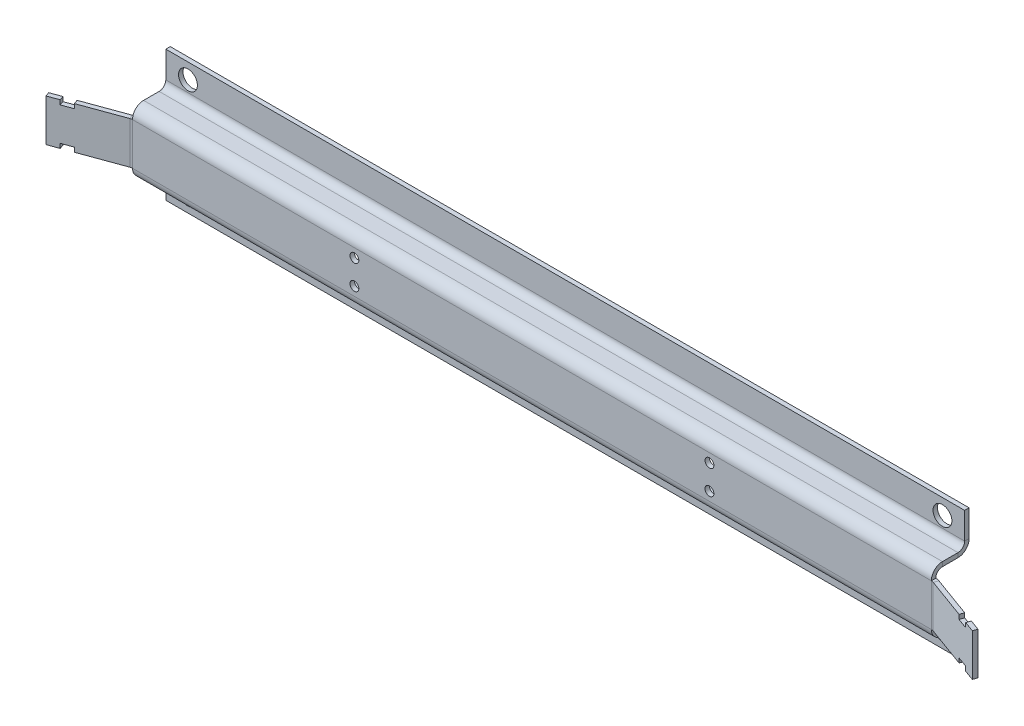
ISO-10303-21;
HEADER;
FILE_DESCRIPTION(('STEP AP214'),'2;1');
FILE_NAME('part.step','',(''),(''),'','','');
FILE_SCHEMA(('AUTOMOTIVE_DESIGN { 1 0 10303 214 1 1 1 1 }'));
ENDSEC;
DATA;
#1=APPLICATION_CONTEXT('core data for automotive mechanical design processes');
#2=APPLICATION_PROTOCOL_DEFINITION('international standard','automotive_design',2000,#1);
#3=PRODUCT_CONTEXT('',#1,'mechanical');
#4=PRODUCT('Part','Part','',(#3));
#5=PRODUCT_RELATED_PRODUCT_CATEGORY('part','',(#4));
#6=PRODUCT_DEFINITION_FORMATION('','',#4);
#7=PRODUCT_DEFINITION_CONTEXT('part definition',#1,'design');
#8=PRODUCT_DEFINITION('design','',#6,#7);
#9=PRODUCT_DEFINITION_SHAPE('','',#8);
#10=(LENGTH_UNIT() NAMED_UNIT(*) SI_UNIT(.MILLI.,.METRE.));
#11=(NAMED_UNIT(*) PLANE_ANGLE_UNIT() SI_UNIT($,.RADIAN.));
#12=(NAMED_UNIT(*) SI_UNIT($,.STERADIAN.) SOLID_ANGLE_UNIT());
#13=UNCERTAINTY_MEASURE_WITH_UNIT(LENGTH_MEASURE(1.E-05),#10,'distance_accuracy_value','');
#14=(GEOMETRIC_REPRESENTATION_CONTEXT(3) GLOBAL_UNCERTAINTY_ASSIGNED_CONTEXT((#13)) GLOBAL_UNIT_ASSIGNED_CONTEXT((#10,
#11,#12)) REPRESENTATION_CONTEXT('',''));
#15=CARTESIAN_POINT('',(0.,0.,0.));
#16=DIRECTION('',(0.,0.,1.));
#17=DIRECTION('',(1.,0.,0.));
#18=AXIS2_PLACEMENT_3D('',#15,#16,#17);
#19=CARTESIAN_POINT('',(209.403799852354,9.50000000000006,10.381219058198));
#20=DIRECTION('',(0.,-1.,0.));
#21=DIRECTION('',(1.,0.,0.));
#22=AXIS2_PLACEMENT_3D('',#19,#20,#21);
#23=PLANE('',#22);
#24=DIRECTION('',(-0.939692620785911,0.,-0.342020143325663));
#25=VECTOR('',#24,1.);
#26=CARTESIAN_POINT('',(208.719759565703,9.50000000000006,12.2606042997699));
#27=LINE('',#26,#25);
#28=CARTESIAN_POINT('',(181.026060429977,9.50000000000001,2.180922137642));
#29=VERTEX_POINT('',#28);
#30=CARTESIAN_POINT('',(199.322833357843,9.50000000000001,8.84040286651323));
#31=VERTEX_POINT('',#30);
#32=EDGE_CURVE('E526',#29,#31,#27,.F.);
#33=ORIENTED_EDGE('',*,*,#32,.T.);
#34=DIRECTION('',(-0.342020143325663,0.,0.939692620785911));
#35=VECTOR('',#34,1.);
#36=CARTESIAN_POINT('',(208.164678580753,9.5,-15.4523672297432));
#37=LINE('',#36,#35);
#38=CARTESIAN_POINT('',(200.006873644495,9.50000000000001,6.9610176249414));
#39=VERTEX_POINT('',#38);
#40=EDGE_CURVE('E414',#39,#31,#37,.T.);
#41=ORIENTED_EDGE('',*,*,#40,.F.);
#42=DIRECTION('',(0.939692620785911,0.,0.342020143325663));
#43=VECTOR('',#42,1.);
#44=CARTESIAN_POINT('',(209.403799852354,9.50000000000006,10.381219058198));
#45=LINE('',#44,#43);
#46=CARTESIAN_POINT('',(181.710100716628,9.50000000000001,0.301536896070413));
#47=VERTEX_POINT('',#46);
#48=EDGE_CURVE('E420',#47,#39,#45,.T.);
#49=ORIENTED_EDGE('',*,*,#48,.F.);
#50=DIRECTION('',(-0.342020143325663,0.,0.939692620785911));
#51=VECTOR('',#50,1.);
#52=CARTESIAN_POINT('',(181.026060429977,9.50000000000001,2.18092213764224));
#53=LINE('',#52,#51);
#54=EDGE_CURVE('E537',#29,#47,#53,.F.);
#55=ORIENTED_EDGE('',*,*,#54,.F.);
#56=EDGE_LOOP('',(#33,#41,#49,#55));
#57=FACE_BOUND('',#56,.T.);
#58=ADVANCED_FACE('F114',(#57),#23,.F.);
#59=CARTESIAN_POINT('',(181.213021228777,-9.50000000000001,0.120614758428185));
#60=DIRECTION('',(0.,1.,0.));
#61=DIRECTION('',(-1.,0.,0.));
#62=AXIS2_PLACEMENT_3D('',#59,#60,#61);
#63=PLANE('',#62);
#64=DIRECTION('',(-0.939692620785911,0.,-0.342020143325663));
#65=VECTOR('',#64,1.);
#66=CARTESIAN_POINT('',(209.403799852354,-9.49999999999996,10.3812190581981));
#67=LINE('',#66,#65);
#68=CARTESIAN_POINT('',(200.006873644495,-9.49999999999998,6.96101762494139));
#69=VERTEX_POINT('',#68);
#70=CARTESIAN_POINT('',(181.710100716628,-9.50000000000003,0.301536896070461));
#71=VERTEX_POINT('',#70);
#72=EDGE_CURVE('E523',#69,#71,#67,.T.);
#73=ORIENTED_EDGE('',*,*,#72,.F.);
#74=DIRECTION('',(-0.342020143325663,0.,0.939692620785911));
#75=VECTOR('',#74,1.);
#76=CARTESIAN_POINT('',(208.164678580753,-9.49999999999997,-15.4523672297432));
#77=LINE('',#76,#75);
#78=CARTESIAN_POINT('',(199.322833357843,-9.49999999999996,8.84040286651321));
#79=VERTEX_POINT('',#78);
#80=EDGE_CURVE('E450',#69,#79,#77,.T.);
#81=ORIENTED_EDGE('',*,*,#80,.T.);
#82=DIRECTION('',(0.939692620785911,0.,0.342020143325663));
#83=VECTOR('',#82,1.);
#84=CARTESIAN_POINT('',(180.528980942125,-9.50000000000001,2.00000000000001));
#85=LINE('',#84,#83);
#86=CARTESIAN_POINT('',(181.026060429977,-9.50000000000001,2.18092213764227));
#87=VERTEX_POINT('',#86);
#88=EDGE_CURVE('E533',#79,#87,#85,.F.);
#89=ORIENTED_EDGE('',*,*,#88,.T.);
#90=DIRECTION('',(-0.342020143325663,0.,0.939692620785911));
#91=VECTOR('',#90,1.);
#92=CARTESIAN_POINT('',(181.710100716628,-9.50000000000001,0.30153689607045));
#93=LINE('',#92,#91);
#94=EDGE_CURVE('E502',#87,#71,#93,.F.);
#95=ORIENTED_EDGE('',*,*,#94,.T.);
#96=EDGE_LOOP('',(#73,#81,#89,#95));
#97=FACE_BOUND('',#96,.T.);
#98=ADVANCED_FACE('F936',(#97),#63,.F.);
#99=CARTESIAN_POINT('',(-181.213021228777,9.50000000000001,0.120614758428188));
#100=DIRECTION('',(0.,-1.,0.));
#101=DIRECTION('',(1.,0.,0.));
#102=AXIS2_PLACEMENT_3D('',#99,#100,#101);
#103=PLANE('',#102);
#104=DIRECTION('',(-0.939692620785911,0.,0.342020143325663));
#105=VECTOR('',#104,1.);
#106=CARTESIAN_POINT('',(-180.528980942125,9.50000000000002,2.00000000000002));
#107=LINE('',#106,#105);
#108=CARTESIAN_POINT('',(-208.719759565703,9.49999999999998,12.2606042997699));
#109=VERTEX_POINT('',#108);
#110=CARTESIAN_POINT('',(-204.021296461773,9.49999999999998,10.5505035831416));
#111=VERTEX_POINT('',#110);
#112=EDGE_CURVE('E573',#109,#111,#107,.F.);
#113=ORIENTED_EDGE('',*,*,#112,.T.);
#114=DIRECTION('',(0.342020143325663,0.,0.93969262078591));
#115=VECTOR('',#114,1.);
#116=CARTESIAN_POINT('',(-212.863141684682,9.49999999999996,-13.7422665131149));
#117=LINE('',#116,#115);
#118=CARTESIAN_POINT('',(-204.705336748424,9.49999999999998,8.67111834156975));
#119=VERTEX_POINT('',#118);
#120=EDGE_CURVE('E471',#119,#111,#117,.T.);
#121=ORIENTED_EDGE('',*,*,#120,.F.);
#122=DIRECTION('',(0.939692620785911,0.,-0.342020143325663));
#123=VECTOR('',#122,1.);
#124=CARTESIAN_POINT('',(-181.213021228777,9.50000000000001,0.12061475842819));
#125=LINE('',#124,#123);
#126=CARTESIAN_POINT('',(-209.403799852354,9.49999999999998,10.3812190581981));
#127=VERTEX_POINT('',#126);
#128=EDGE_CURVE('E563',#127,#119,#125,.T.);
#129=ORIENTED_EDGE('',*,*,#128,.F.);
#130=DIRECTION('',(0.342020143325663,0.,0.939692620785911));
#131=VECTOR('',#130,1.);
#132=CARTESIAN_POINT('',(-209.403799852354,9.49999999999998,10.3812190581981));
#133=LINE('',#132,#131);
#134=EDGE_CURVE('E560',#127,#109,#133,.T.);
#135=ORIENTED_EDGE('',*,*,#134,.T.);
#136=EDGE_LOOP('',(#113,#121,#129,#135));
#137=FACE_BOUND('',#136,.T.);
#138=ADVANCED_FACE('F854',(#137),#103,.F.);
#139=CARTESIAN_POINT('',(-209.403799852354,-9.50000000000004,10.3812190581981));
#140=DIRECTION('',(0.,1.,0.));
#141=DIRECTION('',(-1.,0.,0.));
#142=AXIS2_PLACEMENT_3D('',#139,#140,#141);
#143=PLANE('',#142);
#144=DIRECTION('',(-0.939692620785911,0.,0.342020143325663));
#145=VECTOR('',#144,1.);
#146=CARTESIAN_POINT('',(-181.213021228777,-9.50000000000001,0.1206147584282));
#147=LINE('',#146,#145);
#148=CARTESIAN_POINT('',(-204.705336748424,-9.50000000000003,8.67111834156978));
#149=VERTEX_POINT('',#148);
#150=CARTESIAN_POINT('',(-209.403799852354,-9.50000000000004,10.3812190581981));
#151=VERTEX_POINT('',#150);
#152=EDGE_CURVE('E572',#149,#151,#147,.T.);
#153=ORIENTED_EDGE('',*,*,#152,.F.);
#154=DIRECTION('',(0.342020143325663,0.,0.93969262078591));
#155=VECTOR('',#154,1.);
#156=CARTESIAN_POINT('',(-212.863141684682,-9.50000000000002,-13.7422665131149));
#157=LINE('',#156,#155);
#158=CARTESIAN_POINT('',(-204.021296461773,-9.5,10.5505035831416));
#159=VERTEX_POINT('',#158);
#160=EDGE_CURVE('E499',#149,#159,#157,.T.);
#161=ORIENTED_EDGE('',*,*,#160,.T.);
#162=DIRECTION('',(0.939692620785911,0.,-0.342020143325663));
#163=VECTOR('',#162,1.);
#164=CARTESIAN_POINT('',(-208.719759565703,-9.50000000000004,12.2606042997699));
#165=LINE('',#164,#163);
#166=CARTESIAN_POINT('',(-208.719759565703,-9.50000000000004,12.2606042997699));
#167=VERTEX_POINT('',#166);
#168=EDGE_CURVE('E582',#159,#167,#165,.F.);
#169=ORIENTED_EDGE('',*,*,#168,.T.);
#170=DIRECTION('',(0.342020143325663,0.,0.939692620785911));
#171=VECTOR('',#170,1.);
#172=CARTESIAN_POINT('',(-209.403799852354,-9.50000000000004,10.3812190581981));
#173=LINE('',#172,#171);
#174=EDGE_CURVE('E556',#151,#167,#173,.T.);
#175=ORIENTED_EDGE('',*,*,#174,.F.);
#176=EDGE_LOOP('',(#153,#161,#169,#175));
#177=FACE_BOUND('',#176,.T.);
#178=ADVANCED_FACE('F843',(#177),#143,.F.);
#179=CARTESIAN_POINT('',(180.,-12.5,2.));
#180=DIRECTION('',(0.,0.,1.));
#181=DIRECTION('',(1.,0.,0.));
#182=AXIS2_PLACEMENT_3D('',#179,#180,#181);
#183=PLANE('',#182);
#184=CARTESIAN_POINT('',(79.9999999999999,-5.50000000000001,2.));
#185=DIRECTION('',(0.,0.,1.));
#186=DIRECTION('',(1.,0.,0.));
#187=AXIS2_PLACEMENT_3D('',#184,#185,#186);
#188=CIRCLE('',#187,2.);
#189=CARTESIAN_POINT('',(81.9999999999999,-5.50000000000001,2.));
#190=VERTEX_POINT('',#189);
#191=EDGE_CURVE('E1689',#190,#190,#188,.T.);
#192=ORIENTED_EDGE('',*,*,#191,.F.);
#193=EDGE_LOOP('',(#192));
#194=FACE_BOUND('',#193,.T.);
#195=CARTESIAN_POINT('',(79.9999999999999,5.50000000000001,2.));
#196=DIRECTION('',(0.,0.,1.));
#197=DIRECTION('',(1.,0.,0.));
#198=AXIS2_PLACEMENT_3D('',#195,#196,#197);
#199=CIRCLE('',#198,2.);
#200=CARTESIAN_POINT('',(81.9999999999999,5.50000000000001,2.));
#201=VERTEX_POINT('',#200);
#202=EDGE_CURVE('E1693',#201,#201,#199,.T.);
#203=ORIENTED_EDGE('',*,*,#202,.F.);
#204=EDGE_LOOP('',(#203));
#205=FACE_BOUND('',#204,.T.);
#206=CARTESIAN_POINT('',(-80.,-5.50000000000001,2.));
#207=DIRECTION('',(0.,0.,1.));
#208=DIRECTION('',(1.,0.,0.));
#209=AXIS2_PLACEMENT_3D('',#206,#207,#208);
#210=CIRCLE('',#209,2.);
#211=CARTESIAN_POINT('',(-78.,-5.50000000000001,2.));
#212=VERTEX_POINT('',#211);
#213=EDGE_CURVE('E1702',#212,#212,#210,.T.);
#214=ORIENTED_EDGE('',*,*,#213,.F.);
#215=EDGE_LOOP('',(#214));
#216=FACE_BOUND('',#215,.T.);
#217=CARTESIAN_POINT('',(-80.,5.50000000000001,2.));
#218=DIRECTION('',(0.,0.,1.));
#219=DIRECTION('',(1.,0.,0.));
#220=AXIS2_PLACEMENT_3D('',#217,#218,#219);
#221=CIRCLE('',#220,2.);
#222=CARTESIAN_POINT('',(-78.,5.50000000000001,2.));
#223=VERTEX_POINT('',#222);
#224=EDGE_CURVE('E1708',#223,#223,#221,.T.);
#225=ORIENTED_EDGE('',*,*,#224,.F.);
#226=EDGE_LOOP('',(#225));
#227=FACE_BOUND('',#226,.T.);
#228=DIRECTION('',(0.,1.,0.));
#229=VECTOR('',#228,1.);
#230=CARTESIAN_POINT('',(180.,12.5,2.));
#231=LINE('',#230,#229);
#232=CARTESIAN_POINT('',(180.,-9.50000000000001,2.));
#233=VERTEX_POINT('',#232);
#234=CARTESIAN_POINT('',(180.,9.50000000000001,1.99999999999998));
#235=VERTEX_POINT('',#234);
#236=EDGE_CURVE('E123',#233,#235,#231,.T.);
#237=ORIENTED_EDGE('',*,*,#236,.T.);
#238=DIRECTION('',(1.,0.,0.));
#239=VECTOR('',#238,1.);
#240=CARTESIAN_POINT('',(180.,9.50000000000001,1.99999999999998));
#241=LINE('',#240,#239);
#242=CARTESIAN_POINT('',(-180.,9.50000000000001,2.));
#243=VERTEX_POINT('',#242);
#244=EDGE_CURVE('E720',#235,#243,#241,.F.);
#245=ORIENTED_EDGE('',*,*,#244,.T.);
#246=DIRECTION('',(0.,-1.,0.));
#247=VECTOR('',#246,1.);
#248=CARTESIAN_POINT('',(-180.,12.5,2.));
#249=LINE('',#248,#247);
#250=CARTESIAN_POINT('',(-180.,-9.50000000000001,2.00000000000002));
#251=VERTEX_POINT('',#250);
#252=EDGE_CURVE('E13',#243,#251,#249,.T.);
#253=ORIENTED_EDGE('',*,*,#252,.T.);
#254=DIRECTION('',(-1.,0.,0.));
#255=VECTOR('',#254,1.);
#256=CARTESIAN_POINT('',(-180.,-9.50000000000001,2.00000000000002));
#257=LINE('',#256,#255);
#258=EDGE_CURVE('E774',#251,#233,#257,.F.);
#259=ORIENTED_EDGE('',*,*,#258,.T.);
#260=EDGE_LOOP('',(#237,#245,#253,#259));
#261=FACE_BOUND('',#260,.T.);
#262=ADVANCED_FACE('F874',(#194,#205,#216,#227,#261),#183,.T.);
#263=CARTESIAN_POINT('',(180.,-12.5,0.));
#264=DIRECTION('',(0.,0.,1.));
#265=DIRECTION('',(1.,0.,0.));
#266=AXIS2_PLACEMENT_3D('',#263,#264,#265);
#267=PLANE('',#266);
#268=CARTESIAN_POINT('',(79.9999999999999,-5.50000000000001,0.));
#269=DIRECTION('',(0.,0.,1.));
#270=DIRECTION('',(1.,0.,0.));
#271=AXIS2_PLACEMENT_3D('',#268,#269,#270);
#272=CIRCLE('',#271,2.);
#273=CARTESIAN_POINT('',(81.9999999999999,-5.50000000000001,0.));
#274=VERTEX_POINT('',#273);
#275=EDGE_CURVE('E1692',#274,#274,#272,.F.);
#276=ORIENTED_EDGE('',*,*,#275,.F.);
#277=EDGE_LOOP('',(#276));
#278=FACE_BOUND('',#277,.T.);
#279=CARTESIAN_POINT('',(79.9999999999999,5.50000000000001,0.));
#280=DIRECTION('',(0.,0.,1.));
#281=DIRECTION('',(1.,0.,0.));
#282=AXIS2_PLACEMENT_3D('',#279,#280,#281);
#283=CIRCLE('',#282,2.);
#284=CARTESIAN_POINT('',(81.9999999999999,5.50000000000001,0.));
#285=VERTEX_POINT('',#284);
#286=EDGE_CURVE('E1696',#285,#285,#283,.F.);
#287=ORIENTED_EDGE('',*,*,#286,.F.);
#288=EDGE_LOOP('',(#287));
#289=FACE_BOUND('',#288,.T.);
#290=CARTESIAN_POINT('',(-80.,-5.50000000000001,0.));
#291=DIRECTION('',(0.,0.,1.));
#292=DIRECTION('',(1.,0.,0.));
#293=AXIS2_PLACEMENT_3D('',#290,#291,#292);
#294=CIRCLE('',#293,2.);
#295=CARTESIAN_POINT('',(-78.,-5.50000000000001,0.));
#296=VERTEX_POINT('',#295);
#297=EDGE_CURVE('E1705',#296,#296,#294,.F.);
#298=ORIENTED_EDGE('',*,*,#297,.F.);
#299=EDGE_LOOP('',(#298));
#300=FACE_BOUND('',#299,.T.);
#301=CARTESIAN_POINT('',(-80.,5.50000000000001,0.));
#302=DIRECTION('',(0.,0.,1.));
#303=DIRECTION('',(1.,0.,0.));
#304=AXIS2_PLACEMENT_3D('',#301,#302,#303);
#305=CIRCLE('',#304,2.);
#306=CARTESIAN_POINT('',(-78.,5.50000000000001,0.));
#307=VERTEX_POINT('',#306);
#308=EDGE_CURVE('E1711',#307,#307,#305,.F.);
#309=ORIENTED_EDGE('',*,*,#308,.F.);
#310=EDGE_LOOP('',(#309));
#311=FACE_BOUND('',#310,.T.);
#312=DIRECTION('',(1.,0.,0.));
#313=VECTOR('',#312,1.);
#314=CARTESIAN_POINT('',(180.,9.50000000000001,0.));
#315=LINE('',#314,#313);
#316=CARTESIAN_POINT('',(180.,9.49999999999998,-2.67147415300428E-13));
#317=VERTEX_POINT('',#316);
#318=CARTESIAN_POINT('',(-180.,9.50000000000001,0.));
#319=VERTEX_POINT('',#318);
#320=EDGE_CURVE('E733',#317,#319,#315,.F.);
#321=ORIENTED_EDGE('',*,*,#320,.F.);
#322=DIRECTION('',(0.,1.,0.));
#323=VECTOR('',#322,1.);
#324=CARTESIAN_POINT('',(180.,12.5,0.));
#325=LINE('',#324,#323);
#326=CARTESIAN_POINT('',(180.,-9.50000000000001,0.));
#327=VERTEX_POINT('',#326);
#328=EDGE_CURVE('E794',#327,#317,#325,.T.);
#329=ORIENTED_EDGE('',*,*,#328,.F.);
#330=DIRECTION('',(-1.,0.,0.));
#331=VECTOR('',#330,1.);
#332=CARTESIAN_POINT('',(-180.,-9.50000000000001,0.));
#333=LINE('',#332,#331);
#334=CARTESIAN_POINT('',(-180.,-9.50000000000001,0.));
#335=VERTEX_POINT('',#334);
#336=EDGE_CURVE('E787',#335,#327,#333,.F.);
#337=ORIENTED_EDGE('',*,*,#336,.F.);
#338=DIRECTION('',(0.,-1.,0.));
#339=VECTOR('',#338,1.);
#340=CARTESIAN_POINT('',(-180.,12.5,0.));
#341=LINE('',#340,#339);
#342=EDGE_CURVE('E118',#319,#335,#341,.T.);
#343=ORIENTED_EDGE('',*,*,#342,.F.);
#344=EDGE_LOOP('',(#321,#329,#337,#343));
#345=FACE_BOUND('',#344,.T.);
#346=ADVANCED_FACE('F116',(#278,#289,#300,#311,#345),#267,.F.);
#347=CARTESIAN_POINT('',(180.,-9.50000000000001,-3.00000000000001));
#348=DIRECTION('',(1.,0.,0.));
#349=DIRECTION('',(0.,0.,-1.));
#350=AXIS2_PLACEMENT_3D('',#347,#348,#349);
#351=PLANE('',#350);
#352=DIRECTION('',(0.,-1.,0.));
#353=VECTOR('',#352,1.);
#354=CARTESIAN_POINT('',(180.,-12.5,-2.99999999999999));
#355=LINE('',#354,#353);
#356=CARTESIAN_POINT('',(180.,-12.5,-3.));
#357=VERTEX_POINT('',#356);
#358=CARTESIAN_POINT('',(180.,-14.5,-2.99999999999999));
#359=VERTEX_POINT('',#358);
#360=EDGE_CURVE('E740',#357,#359,#355,.T.);
#361=ORIENTED_EDGE('',*,*,#360,.F.);
#362=CARTESIAN_POINT('',(180.,-9.50000000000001,-3.00000000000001));
#363=DIRECTION('',(-1.,0.,0.));
#364=DIRECTION('',(0.,0.,1.));
#365=AXIS2_PLACEMENT_3D('',#362,#363,#364);
#366=CIRCLE('',#365,3.);
#367=EDGE_CURVE('E784',#327,#357,#366,.F.);
#368=ORIENTED_EDGE('',*,*,#367,.F.);
#369=DIRECTION('',(0.,0.,1.));
#370=VECTOR('',#369,1.);
#371=CARTESIAN_POINT('',(180.,-9.50000000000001,0.));
#372=LINE('',#371,#370);
#373=EDGE_CURVE('E791',#327,#233,#372,.T.);
#374=ORIENTED_EDGE('',*,*,#373,.T.);
#375=CARTESIAN_POINT('',(180.,-9.50000000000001,-3.00000000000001));
#376=DIRECTION('',(-1.,0.,0.));
#377=DIRECTION('',(0.,0.,1.));
#378=AXIS2_PLACEMENT_3D('',#375,#376,#377);
#379=CIRCLE('',#378,5.);
#380=EDGE_CURVE('E777',#233,#359,#379,.F.);
#381=ORIENTED_EDGE('',*,*,#380,.T.);
#382=EDGE_LOOP('',(#361,#368,#374,#381));
#383=FACE_BOUND('',#382,.T.);
#384=ADVANCED_FACE('F1141',(#383),#351,.T.);
#385=CARTESIAN_POINT('',(-180.,-9.50000000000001,-2.99999999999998));
#386=DIRECTION('',(1.,0.,0.));
#387=DIRECTION('',(0.,0.,-1.));
#388=AXIS2_PLACEMENT_3D('',#385,#386,#387);
#389=PLANE('',#388);
#390=CARTESIAN_POINT('',(-180.,-9.50000000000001,-2.99999999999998));
#391=DIRECTION('',(-1.,0.,0.));
#392=DIRECTION('',(0.,0.,1.));
#393=AXIS2_PLACEMENT_3D('',#390,#391,#392);
#394=CIRCLE('',#393,3.);
#395=CARTESIAN_POINT('',(-180.,-12.5,-2.99999999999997));
#396=VERTEX_POINT('',#395);
#397=EDGE_CURVE('E773',#396,#335,#394,.T.);
#398=ORIENTED_EDGE('',*,*,#397,.F.);
#399=DIRECTION('',(0.,-1.,0.));
#400=VECTOR('',#399,1.);
#401=CARTESIAN_POINT('',(-180.,-12.5,-2.99999999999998));
#402=LINE('',#401,#400);
#403=CARTESIAN_POINT('',(-180.,-14.5,-2.99999999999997));
#404=VERTEX_POINT('',#403);
#405=EDGE_CURVE('E745',#396,#404,#402,.T.);
#406=ORIENTED_EDGE('',*,*,#405,.T.);
#407=CARTESIAN_POINT('',(-180.,-9.50000000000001,-2.99999999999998));
#408=DIRECTION('',(-1.,0.,0.));
#409=DIRECTION('',(0.,0.,1.));
#410=AXIS2_PLACEMENT_3D('',#407,#408,#409);
#411=CIRCLE('',#410,5.);
#412=EDGE_CURVE('E778',#404,#251,#411,.T.);
#413=ORIENTED_EDGE('',*,*,#412,.T.);
#414=DIRECTION('',(0.,0.,1.));
#415=VECTOR('',#414,1.);
#416=CARTESIAN_POINT('',(-180.,-9.50000000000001,0.));
#417=LINE('',#416,#415);
#418=EDGE_CURVE('E781',#335,#251,#417,.T.);
#419=ORIENTED_EDGE('',*,*,#418,.F.);
#420=EDGE_LOOP('',(#398,#406,#413,#419));
#421=FACE_BOUND('',#420,.T.);
#422=ADVANCED_FACE('F1148',(#421),#389,.F.);
#423=CARTESIAN_POINT('',(-180.,-9.50000000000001,-2.99999999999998));
#424=DIRECTION('',(-1.,0.,0.));
#425=DIRECTION('',(0.,-1.,0.));
#426=AXIS2_PLACEMENT_3D('',#423,#424,#425);
#427=CYLINDRICAL_SURFACE('',#426,5.);
#428=ORIENTED_EDGE('',*,*,#258,.F.);
#429=ORIENTED_EDGE('',*,*,#412,.F.);
#430=DIRECTION('',(1.,0.,0.));
#431=VECTOR('',#430,1.);
#432=CARTESIAN_POINT('',(-180.,-14.5,-2.99999999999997));
#433=LINE('',#432,#431);
#434=EDGE_CURVE('E748',#404,#359,#433,.T.);
#435=ORIENTED_EDGE('',*,*,#434,.T.);
#436=ORIENTED_EDGE('',*,*,#380,.F.);
#437=EDGE_LOOP('',(#428,#429,#435,#436));
#438=FACE_BOUND('',#437,.T.);
#439=ADVANCED_FACE('F1151',(#438),#427,.T.);
#440=CARTESIAN_POINT('',(-180.,-9.50000000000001,-2.99999999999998));
#441=DIRECTION('',(-1.,0.,0.));
#442=DIRECTION('',(0.,-1.,0.));
#443=AXIS2_PLACEMENT_3D('',#440,#441,#442);
#444=CYLINDRICAL_SURFACE('',#443,3.);
#445=ORIENTED_EDGE('',*,*,#336,.T.);
#446=ORIENTED_EDGE('',*,*,#367,.T.);
#447=DIRECTION('',(-1.,0.,0.));
#448=VECTOR('',#447,1.);
#449=CARTESIAN_POINT('',(180.,-12.5,-2.99999999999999));
#450=LINE('',#449,#448);
#451=EDGE_CURVE('E743',#357,#396,#450,.T.);
#452=ORIENTED_EDGE('',*,*,#451,.T.);
#453=ORIENTED_EDGE('',*,*,#397,.T.);
#454=EDGE_LOOP('',(#445,#446,#452,#453));
#455=FACE_BOUND('',#454,.T.);
#456=ADVANCED_FACE('F1159',(#455),#444,.F.);
#457=CARTESIAN_POINT('',(-180.,-14.5,-9.99999999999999));
#458=DIRECTION('',(1.,0.,0.));
#459=DIRECTION('',(0.,0.,-1.));
#460=AXIS2_PLACEMENT_3D('',#457,#458,#459);
#461=PLANE('',#460);
#462=ORIENTED_EDGE('',*,*,#405,.F.);
#463=DIRECTION('',(0.,0.,-1.));
#464=VECTOR('',#463,1.);
#465=CARTESIAN_POINT('',(-180.,-12.5,-10.));
#466=LINE('',#465,#464);
#467=CARTESIAN_POINT('',(-180.,-12.5,-10.));
#468=VERTEX_POINT('',#467);
#469=EDGE_CURVE('E752',#396,#468,#466,.T.);
#470=ORIENTED_EDGE('',*,*,#469,.T.);
#471=DIRECTION('',(0.,1.,0.));
#472=VECTOR('',#471,1.);
#473=CARTESIAN_POINT('',(-180.,-14.5,-9.99999999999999));
#474=LINE('',#473,#472);
#475=CARTESIAN_POINT('',(-180.,-14.5,-9.99999999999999));
#476=VERTEX_POINT('',#475);
#477=EDGE_CURVE('E770',#476,#468,#474,.T.);
#478=ORIENTED_EDGE('',*,*,#477,.F.);
#479=DIRECTION('',(0.,0.,-1.));
#480=VECTOR('',#479,1.);
#481=CARTESIAN_POINT('',(-180.,-14.5,-9.99999999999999));
#482=LINE('',#481,#480);
#483=EDGE_CURVE('E753',#404,#476,#482,.T.);
#484=ORIENTED_EDGE('',*,*,#483,.F.);
#485=EDGE_LOOP('',(#462,#470,#478,#484));
#486=FACE_BOUND('',#485,.T.);
#487=ADVANCED_FACE('F1172',(#486),#461,.F.);
#488=CARTESIAN_POINT('',(180.,-14.5,0.));
#489=DIRECTION('',(-1.,0.,0.));
#490=DIRECTION('',(0.,0.,1.));
#491=AXIS2_PLACEMENT_3D('',#488,#489,#490);
#492=PLANE('',#491);
#493=ORIENTED_EDGE('',*,*,#360,.T.);
#494=DIRECTION('',(0.,0.,1.));
#495=VECTOR('',#494,1.);
#496=CARTESIAN_POINT('',(180.,-14.5,0.));
#497=LINE('',#496,#495);
#498=CARTESIAN_POINT('',(180.,-14.5,-9.99999999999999));
#499=VERTEX_POINT('',#498);
#500=EDGE_CURVE('E758',#499,#359,#497,.T.);
#501=ORIENTED_EDGE('',*,*,#500,.F.);
#502=DIRECTION('',(0.,1.,0.));
#503=VECTOR('',#502,1.);
#504=CARTESIAN_POINT('',(180.,-14.5,-9.99999999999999));
#505=LINE('',#504,#503);
#506=CARTESIAN_POINT('',(180.,-12.5,-10.));
#507=VERTEX_POINT('',#506);
#508=EDGE_CURVE('E761',#499,#507,#505,.T.);
#509=ORIENTED_EDGE('',*,*,#508,.T.);
#510=DIRECTION('',(0.,0.,1.));
#511=VECTOR('',#510,1.);
#512=CARTESIAN_POINT('',(180.,-12.5,0.));
#513=LINE('',#512,#511);
#514=EDGE_CURVE('E756',#507,#357,#513,.T.);
#515=ORIENTED_EDGE('',*,*,#514,.T.);
#516=EDGE_LOOP('',(#493,#501,#509,#515));
#517=FACE_BOUND('',#516,.T.);
#518=ADVANCED_FACE('F1181',(#517),#492,.F.);
#519=CARTESIAN_POINT('',(-180.,-14.5,0.));
#520=DIRECTION('',(0.,1.,0.));
#521=DIRECTION('',(0.,0.,1.));
#522=AXIS2_PLACEMENT_3D('',#519,#520,#521);
#523=PLANE('',#522);
#524=ORIENTED_EDGE('',*,*,#434,.F.);
#525=ORIENTED_EDGE('',*,*,#483,.T.);
#526=DIRECTION('',(1.,0.,0.));
#527=VECTOR('',#526,1.);
#528=CARTESIAN_POINT('',(180.,-14.5,-9.99999999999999));
#529=LINE('',#528,#527);
#530=EDGE_CURVE('E755',#476,#499,#529,.T.);
#531=ORIENTED_EDGE('',*,*,#530,.T.);
#532=ORIENTED_EDGE('',*,*,#500,.T.);
#533=EDGE_LOOP('',(#524,#525,#531,#532));
#534=FACE_BOUND('',#533,.T.);
#535=ADVANCED_FACE('F1189',(#534),#523,.F.);
#536=CARTESIAN_POINT('',(-180.,-12.5,0.));
#537=DIRECTION('',(0.,1.,0.));
#538=DIRECTION('',(0.,0.,1.));
#539=AXIS2_PLACEMENT_3D('',#536,#537,#538);
#540=PLANE('',#539);
#541=ORIENTED_EDGE('',*,*,#469,.F.);
#542=ORIENTED_EDGE('',*,*,#451,.F.);
#543=ORIENTED_EDGE('',*,*,#514,.F.);
#544=DIRECTION('',(1.,0.,0.));
#545=VECTOR('',#544,1.);
#546=CARTESIAN_POINT('',(180.,-12.5,-10.));
#547=LINE('',#546,#545);
#548=EDGE_CURVE('E763',#468,#507,#547,.T.);
#549=ORIENTED_EDGE('',*,*,#548,.F.);
#550=EDGE_LOOP('',(#541,#542,#543,#549));
#551=FACE_BOUND('',#550,.T.);
#552=ADVANCED_FACE('F1197',(#551),#540,.T.);
#553=CARTESIAN_POINT('',(-180.,9.50000000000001,-2.99999999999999));
#554=DIRECTION('',(-1.,0.,0.));
#555=DIRECTION('',(0.,0.,1.));
#556=AXIS2_PLACEMENT_3D('',#553,#554,#555);
#557=PLANE('',#556);
#558=DIRECTION('',(0.,1.,0.));
#559=VECTOR('',#558,1.);
#560=CARTESIAN_POINT('',(-180.,12.5,-2.99999999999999));
#561=LINE('',#560,#559);
#562=CARTESIAN_POINT('',(-180.,12.5,-2.99999999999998));
#563=VERTEX_POINT('',#562);
#564=CARTESIAN_POINT('',(-180.,14.5,-2.99999999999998));
#565=VERTEX_POINT('',#564);
#566=EDGE_CURVE('E680',#563,#565,#561,.T.);
#567=ORIENTED_EDGE('',*,*,#566,.F.);
#568=CARTESIAN_POINT('',(-180.,9.50000000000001,-2.99999999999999));
#569=DIRECTION('',(1.,0.,0.));
#570=DIRECTION('',(0.,0.,-1.));
#571=AXIS2_PLACEMENT_3D('',#568,#569,#570);
#572=CIRCLE('',#571,3.);
#573=EDGE_CURVE('E730',#319,#563,#572,.F.);
#574=ORIENTED_EDGE('',*,*,#573,.F.);
#575=DIRECTION('',(0.,0.,1.));
#576=VECTOR('',#575,1.);
#577=CARTESIAN_POINT('',(-180.,9.50000000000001,0.));
#578=LINE('',#577,#576);
#579=EDGE_CURVE('E737',#319,#243,#578,.T.);
#580=ORIENTED_EDGE('',*,*,#579,.T.);
#581=CARTESIAN_POINT('',(-180.,9.50000000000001,-2.99999999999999));
#582=DIRECTION('',(1.,0.,0.));
#583=DIRECTION('',(0.,0.,-1.));
#584=AXIS2_PLACEMENT_3D('',#581,#582,#583);
#585=CIRCLE('',#584,5.);
#586=EDGE_CURVE('E723',#243,#565,#585,.F.);
#587=ORIENTED_EDGE('',*,*,#586,.T.);
#588=EDGE_LOOP('',(#567,#574,#580,#587));
#589=FACE_BOUND('',#588,.T.);
#590=ADVANCED_FACE('F1205',(#589),#557,.T.);
#591=CARTESIAN_POINT('',(180.,9.50000000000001,-3.00000000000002));
#592=DIRECTION('',(-1.,0.,0.));
#593=DIRECTION('',(0.,0.,1.));
#594=AXIS2_PLACEMENT_3D('',#591,#592,#593);
#595=PLANE('',#594);
#596=CARTESIAN_POINT('',(180.,9.50000000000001,-3.00000000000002));
#597=DIRECTION('',(1.,0.,0.));
#598=DIRECTION('',(0.,0.,-1.));
#599=AXIS2_PLACEMENT_3D('',#596,#597,#598);
#600=CIRCLE('',#599,3.);
#601=CARTESIAN_POINT('',(180.,12.5,-3.00000000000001));
#602=VERTEX_POINT('',#601);
#603=EDGE_CURVE('E719',#602,#317,#600,.T.);
#604=ORIENTED_EDGE('',*,*,#603,.F.);
#605=DIRECTION('',(0.,1.,0.));
#606=VECTOR('',#605,1.);
#607=CARTESIAN_POINT('',(180.,12.5,-3.));
#608=LINE('',#607,#606);
#609=CARTESIAN_POINT('',(180.,14.5,-2.99999999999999));
#610=VERTEX_POINT('',#609);
#611=EDGE_CURVE('E691',#602,#610,#608,.T.);
#612=ORIENTED_EDGE('',*,*,#611,.T.);
#613=CARTESIAN_POINT('',(180.,9.50000000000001,-3.00000000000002));
#614=DIRECTION('',(1.,0.,0.));
#615=DIRECTION('',(0.,0.,-1.));
#616=AXIS2_PLACEMENT_3D('',#613,#614,#615);
#617=CIRCLE('',#616,5.);
#618=EDGE_CURVE('E724',#610,#235,#617,.T.);
#619=ORIENTED_EDGE('',*,*,#618,.T.);
#620=DIRECTION('',(0.,0.,1.));
#621=VECTOR('',#620,1.);
#622=CARTESIAN_POINT('',(180.,9.50000000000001,0.));
#623=LINE('',#622,#621);
#624=EDGE_CURVE('E727',#317,#235,#623,.T.);
#625=ORIENTED_EDGE('',*,*,#624,.F.);
#626=EDGE_LOOP('',(#604,#612,#619,#625));
#627=FACE_BOUND('',#626,.T.);
#628=ADVANCED_FACE('F881',(#627),#595,.F.);
#629=CARTESIAN_POINT('',(180.,9.50000000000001,-3.00000000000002));
#630=DIRECTION('',(1.,0.,0.));
#631=DIRECTION('',(0.,1.,0.));
#632=AXIS2_PLACEMENT_3D('',#629,#630,#631);
#633=CYLINDRICAL_SURFACE('',#632,5.);
#634=ORIENTED_EDGE('',*,*,#244,.F.);
#635=ORIENTED_EDGE('',*,*,#618,.F.);
#636=DIRECTION('',(-1.,0.,0.));
#637=VECTOR('',#636,1.);
#638=CARTESIAN_POINT('',(180.,14.5,-2.99999999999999));
#639=LINE('',#638,#637);
#640=EDGE_CURVE('E694',#610,#565,#639,.T.);
#641=ORIENTED_EDGE('',*,*,#640,.T.);
#642=ORIENTED_EDGE('',*,*,#586,.F.);
#643=EDGE_LOOP('',(#634,#635,#641,#642));
#644=FACE_BOUND('',#643,.T.);
#645=ADVANCED_FACE('F877',(#644),#633,.T.);
#646=CARTESIAN_POINT('',(180.,9.50000000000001,-3.00000000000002));
#647=DIRECTION('',(1.,0.,0.));
#648=DIRECTION('',(0.,1.,0.));
#649=AXIS2_PLACEMENT_3D('',#646,#647,#648);
#650=CYLINDRICAL_SURFACE('',#649,3.);
#651=ORIENTED_EDGE('',*,*,#320,.T.);
#652=ORIENTED_EDGE('',*,*,#573,.T.);
#653=DIRECTION('',(1.,0.,0.));
#654=VECTOR('',#653,1.);
#655=CARTESIAN_POINT('',(-180.,12.5,-2.99999999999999));
#656=LINE('',#655,#654);
#657=EDGE_CURVE('E689',#563,#602,#656,.T.);
#658=ORIENTED_EDGE('',*,*,#657,.T.);
#659=ORIENTED_EDGE('',*,*,#603,.T.);
#660=EDGE_LOOP('',(#651,#652,#658,#659));
#661=FACE_BOUND('',#660,.T.);
#662=ADVANCED_FACE('F1221',(#661),#650,.F.);
#663=CARTESIAN_POINT('',(180.,14.5,-9.99999999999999));
#664=DIRECTION('',(-1.,0.,0.));
#665=DIRECTION('',(0.,0.,1.));
#666=AXIS2_PLACEMENT_3D('',#663,#664,#665);
#667=PLANE('',#666);
#668=ORIENTED_EDGE('',*,*,#611,.F.);
#669=DIRECTION('',(0.,0.,-1.));
#670=VECTOR('',#669,1.);
#671=CARTESIAN_POINT('',(180.,12.5,-10.));
#672=LINE('',#671,#670);
#673=CARTESIAN_POINT('',(180.,12.5,-10.));
#674=VERTEX_POINT('',#673);
#675=EDGE_CURVE('E698',#602,#674,#672,.T.);
#676=ORIENTED_EDGE('',*,*,#675,.T.);
#677=DIRECTION('',(0.,-1.,0.));
#678=VECTOR('',#677,1.);
#679=CARTESIAN_POINT('',(180.,14.5,-9.99999999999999));
#680=LINE('',#679,#678);
#681=CARTESIAN_POINT('',(180.,14.5,-9.99999999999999));
#682=VERTEX_POINT('',#681);
#683=EDGE_CURVE('E716',#682,#674,#680,.T.);
#684=ORIENTED_EDGE('',*,*,#683,.F.);
#685=DIRECTION('',(0.,0.,-1.));
#686=VECTOR('',#685,1.);
#687=CARTESIAN_POINT('',(180.,14.5,-9.99999999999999));
#688=LINE('',#687,#686);
#689=EDGE_CURVE('E699',#610,#682,#688,.T.);
#690=ORIENTED_EDGE('',*,*,#689,.F.);
#691=EDGE_LOOP('',(#668,#676,#684,#690));
#692=FACE_BOUND('',#691,.T.);
#693=ADVANCED_FACE('F891',(#692),#667,.F.);
#694=CARTESIAN_POINT('',(-180.,14.5,0.));
#695=DIRECTION('',(1.,0.,0.));
#696=DIRECTION('',(0.,0.,-1.));
#697=AXIS2_PLACEMENT_3D('',#694,#695,#696);
#698=PLANE('',#697);
#699=ORIENTED_EDGE('',*,*,#566,.T.);
#700=DIRECTION('',(0.,0.,1.));
#701=VECTOR('',#700,1.);
#702=CARTESIAN_POINT('',(-180.,14.5,0.));
#703=LINE('',#702,#701);
#704=CARTESIAN_POINT('',(-180.,14.5,-9.99999999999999));
#705=VERTEX_POINT('',#704);
#706=EDGE_CURVE('E704',#705,#565,#703,.T.);
#707=ORIENTED_EDGE('',*,*,#706,.F.);
#708=DIRECTION('',(0.,-1.,0.));
#709=VECTOR('',#708,1.);
#710=CARTESIAN_POINT('',(-180.,14.5,-9.99999999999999));
#711=LINE('',#710,#709);
#712=CARTESIAN_POINT('',(-180.,12.5,-10.));
#713=VERTEX_POINT('',#712);
#714=EDGE_CURVE('E707',#705,#713,#711,.T.);
#715=ORIENTED_EDGE('',*,*,#714,.T.);
#716=DIRECTION('',(0.,0.,1.));
#717=VECTOR('',#716,1.);
#718=CARTESIAN_POINT('',(-180.,12.5,0.));
#719=LINE('',#718,#717);
#720=EDGE_CURVE('E702',#713,#563,#719,.T.);
#721=ORIENTED_EDGE('',*,*,#720,.T.);
#722=EDGE_LOOP('',(#699,#707,#715,#721));
#723=FACE_BOUND('',#722,.T.);
#724=ADVANCED_FACE('F1238',(#723),#698,.F.);
#725=CARTESIAN_POINT('',(180.,14.5,0.));
#726=DIRECTION('',(0.,-1.,0.));
#727=DIRECTION('',(0.,0.,-1.));
#728=AXIS2_PLACEMENT_3D('',#725,#726,#727);
#729=PLANE('',#728);
#730=ORIENTED_EDGE('',*,*,#640,.F.);
#731=ORIENTED_EDGE('',*,*,#689,.T.);
#732=DIRECTION('',(-1.,0.,0.));
#733=VECTOR('',#732,1.);
#734=CARTESIAN_POINT('',(-180.,14.5,-9.99999999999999));
#735=LINE('',#734,#733);
#736=EDGE_CURVE('E701',#682,#705,#735,.T.);
#737=ORIENTED_EDGE('',*,*,#736,.T.);
#738=ORIENTED_EDGE('',*,*,#706,.T.);
#739=EDGE_LOOP('',(#730,#731,#737,#738));
#740=FACE_BOUND('',#739,.T.);
#741=ADVANCED_FACE('F888',(#740),#729,.F.);
#742=CARTESIAN_POINT('',(180.,12.5,0.));
#743=DIRECTION('',(0.,-1.,0.));
#744=DIRECTION('',(0.,0.,-1.));
#745=AXIS2_PLACEMENT_3D('',#742,#743,#744);
#746=PLANE('',#745);
#747=ORIENTED_EDGE('',*,*,#675,.F.);
#748=ORIENTED_EDGE('',*,*,#657,.F.);
#749=ORIENTED_EDGE('',*,*,#720,.F.);
#750=DIRECTION('',(-1.,0.,0.));
#751=VECTOR('',#750,1.);
#752=CARTESIAN_POINT('',(-180.,12.5,-10.));
#753=LINE('',#752,#751);
#754=EDGE_CURVE('E709',#674,#713,#753,.T.);
#755=ORIENTED_EDGE('',*,*,#754,.F.);
#756=EDGE_LOOP('',(#747,#748,#749,#755));
#757=FACE_BOUND('',#756,.T.);
#758=ADVANCED_FACE('F1252',(#757),#746,.T.);
#759=CARTESIAN_POINT('',(-180.,-17.5,-9.99999999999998));
#760=DIRECTION('',(-1.,0.,0.));
#761=DIRECTION('',(0.,0.,1.));
#762=AXIS2_PLACEMENT_3D('',#759,#760,#761);
#763=PLANE('',#762);
#764=DIRECTION('',(0.,0.,1.));
#765=VECTOR('',#764,1.);
#766=CARTESIAN_POINT('',(-180.,-17.5,-15.));
#767=LINE('',#766,#765);
#768=CARTESIAN_POINT('',(-180.,-17.5,-13.));
#769=VERTEX_POINT('',#768);
#770=CARTESIAN_POINT('',(-180.,-17.5,-15.));
#771=VERTEX_POINT('',#770);
#772=EDGE_CURVE('E638',#769,#771,#767,.F.);
#773=ORIENTED_EDGE('',*,*,#772,.F.);
#774=CARTESIAN_POINT('',(-180.,-17.5,-9.99999999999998));
#775=DIRECTION('',(1.,0.,0.));
#776=DIRECTION('',(0.,0.,-1.));
#777=AXIS2_PLACEMENT_3D('',#774,#775,#776);
#778=CIRCLE('',#777,3.);
#779=EDGE_CURVE('E684',#476,#769,#778,.F.);
#780=ORIENTED_EDGE('',*,*,#779,.F.);
#781=ORIENTED_EDGE('',*,*,#477,.T.);
#782=CARTESIAN_POINT('',(-180.,-17.5,-9.99999999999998));
#783=DIRECTION('',(1.,0.,0.));
#784=DIRECTION('',(0.,0.,-1.));
#785=AXIS2_PLACEMENT_3D('',#782,#783,#784);
#786=CIRCLE('',#785,5.);
#787=EDGE_CURVE('E677',#468,#771,#786,.F.);
#788=ORIENTED_EDGE('',*,*,#787,.T.);
#789=EDGE_LOOP('',(#773,#780,#781,#788));
#790=FACE_BOUND('',#789,.T.);
#791=ADVANCED_FACE('F1259',(#790),#763,.T.);
#792=CARTESIAN_POINT('',(180.,-17.5,-9.99999999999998));
#793=DIRECTION('',(-1.,0.,0.));
#794=DIRECTION('',(0.,0.,1.));
#795=AXIS2_PLACEMENT_3D('',#792,#793,#794);
#796=PLANE('',#795);
#797=CARTESIAN_POINT('',(180.,-17.5,-9.99999999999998));
#798=DIRECTION('',(1.,0.,0.));
#799=DIRECTION('',(0.,0.,-1.));
#800=AXIS2_PLACEMENT_3D('',#797,#798,#799);
#801=CIRCLE('',#800,3.);
#802=CARTESIAN_POINT('',(180.,-17.5,-13.));
#803=VERTEX_POINT('',#802);
#804=EDGE_CURVE('E650',#803,#499,#801,.T.);
#805=ORIENTED_EDGE('',*,*,#804,.F.);
#806=DIRECTION('',(0.,0.,1.));
#807=VECTOR('',#806,1.);
#808=CARTESIAN_POINT('',(180.,-17.5,-13.));
#809=LINE('',#808,#807);
#810=CARTESIAN_POINT('',(180.,-17.5,-15.));
#811=VERTEX_POINT('',#810);
#812=EDGE_CURVE('E670',#803,#811,#809,.F.);
#813=ORIENTED_EDGE('',*,*,#812,.T.);
#814=CARTESIAN_POINT('',(180.,-17.5,-9.99999999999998));
#815=DIRECTION('',(1.,0.,0.));
#816=DIRECTION('',(0.,0.,-1.));
#817=AXIS2_PLACEMENT_3D('',#814,#815,#816);
#818=CIRCLE('',#817,5.);
#819=EDGE_CURVE('E681',#811,#507,#818,.T.);
#820=ORIENTED_EDGE('',*,*,#819,.T.);
#821=ORIENTED_EDGE('',*,*,#508,.F.);
#822=EDGE_LOOP('',(#805,#813,#820,#821));
#823=FACE_BOUND('',#822,.T.);
#824=ADVANCED_FACE('F1267',(#823),#796,.F.);
#825=CARTESIAN_POINT('',(180.,-17.5,-9.99999999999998));
#826=DIRECTION('',(1.,0.,0.));
#827=DIRECTION('',(0.,0.,-1.));
#828=AXIS2_PLACEMENT_3D('',#825,#826,#827);
#829=CYLINDRICAL_SURFACE('',#828,5.);
#830=ORIENTED_EDGE('',*,*,#548,.T.);
#831=ORIENTED_EDGE('',*,*,#819,.F.);
#832=DIRECTION('',(1.,0.,0.));
#833=VECTOR('',#832,1.);
#834=CARTESIAN_POINT('',(-180.,-17.5,-15.));
#835=LINE('',#834,#833);
#836=EDGE_CURVE('E668',#811,#771,#835,.F.);
#837=ORIENTED_EDGE('',*,*,#836,.T.);
#838=ORIENTED_EDGE('',*,*,#787,.F.);
#839=EDGE_LOOP('',(#830,#831,#837,#838));
#840=FACE_BOUND('',#839,.T.);
#841=ADVANCED_FACE('F1270',(#840),#829,.T.);
#842=CARTESIAN_POINT('',(180.,-17.5,-9.99999999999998));
#843=DIRECTION('',(1.,0.,0.));
#844=DIRECTION('',(0.,0.,-1.));
#845=AXIS2_PLACEMENT_3D('',#842,#843,#844);
#846=CYLINDRICAL_SURFACE('',#845,3.);
#847=ORIENTED_EDGE('',*,*,#530,.F.);
#848=ORIENTED_EDGE('',*,*,#779,.T.);
#849=DIRECTION('',(1.,0.,0.));
#850=VECTOR('',#849,1.);
#851=CARTESIAN_POINT('',(-180.,-17.5,-13.));
#852=LINE('',#851,#850);
#853=EDGE_CURVE('E673',#769,#803,#852,.T.);
#854=ORIENTED_EDGE('',*,*,#853,.T.);
#855=ORIENTED_EDGE('',*,*,#804,.T.);
#856=EDGE_LOOP('',(#847,#848,#854,#855));
#857=FACE_BOUND('',#856,.T.);
#858=ADVANCED_FACE('F1278',(#857),#846,.F.);
#859=CARTESIAN_POINT('',(180.,-29.5,-15.));
#860=DIRECTION('',(-1.,0.,0.));
#861=DIRECTION('',(0.,0.,1.));
#862=AXIS2_PLACEMENT_3D('',#859,#860,#861);
#863=PLANE('',#862);
#864=ORIENTED_EDGE('',*,*,#812,.F.);
#865=DIRECTION('',(0.,1.,0.));
#866=VECTOR('',#865,1.);
#867=CARTESIAN_POINT('',(180.,-29.5,-13.));
#868=LINE('',#867,#866);
#869=CARTESIAN_POINT('',(180.,-29.5,-13.));
#870=VERTEX_POINT('',#869);
#871=EDGE_CURVE('E666',#803,#870,#868,.F.);
#872=ORIENTED_EDGE('',*,*,#871,.T.);
#873=DIRECTION('',(0.,0.,1.));
#874=VECTOR('',#873,1.);
#875=CARTESIAN_POINT('',(180.,-29.5,-15.));
#876=LINE('',#875,#874);
#877=CARTESIAN_POINT('',(180.,-29.5,-15.));
#878=VERTEX_POINT('',#877);
#879=EDGE_CURVE('E647',#878,#870,#876,.T.);
#880=ORIENTED_EDGE('',*,*,#879,.F.);
#881=DIRECTION('',(0.,-1.,0.));
#882=VECTOR('',#881,1.);
#883=CARTESIAN_POINT('',(180.,-14.5,-15.));
#884=LINE('',#883,#882);
#885=EDGE_CURVE('E659',#811,#878,#884,.T.);
#886=ORIENTED_EDGE('',*,*,#885,.F.);
#887=EDGE_LOOP('',(#864,#872,#880,#886));
#888=FACE_BOUND('',#887,.T.);
#889=ADVANCED_FACE('F1291',(#888),#863,.F.);
#890=CARTESIAN_POINT('',(-180.,-14.5,-15.));
#891=DIRECTION('',(1.,0.,0.));
#892=DIRECTION('',(0.,0.,-1.));
#893=AXIS2_PLACEMENT_3D('',#890,#891,#892);
#894=PLANE('',#893);
#895=ORIENTED_EDGE('',*,*,#772,.T.);
#896=DIRECTION('',(0.,1.,0.));
#897=VECTOR('',#896,1.);
#898=CARTESIAN_POINT('',(-180.,-14.5,-15.));
#899=LINE('',#898,#897);
#900=CARTESIAN_POINT('',(-180.,-29.5,-15.));
#901=VERTEX_POINT('',#900);
#902=EDGE_CURVE('E654',#901,#771,#899,.T.);
#903=ORIENTED_EDGE('',*,*,#902,.F.);
#904=DIRECTION('',(0.,0.,1.));
#905=VECTOR('',#904,1.);
#906=CARTESIAN_POINT('',(-180.,-29.5,-15.));
#907=LINE('',#906,#905);
#908=CARTESIAN_POINT('',(-180.,-29.5,-13.));
#909=VERTEX_POINT('',#908);
#910=EDGE_CURVE('E651',#901,#909,#907,.T.);
#911=ORIENTED_EDGE('',*,*,#910,.T.);
#912=DIRECTION('',(0.,-1.,0.));
#913=VECTOR('',#912,1.);
#914=CARTESIAN_POINT('',(-180.,-14.5,-13.));
#915=LINE('',#914,#913);
#916=EDGE_CURVE('E661',#909,#769,#915,.F.);
#917=ORIENTED_EDGE('',*,*,#916,.T.);
#918=EDGE_LOOP('',(#895,#903,#911,#917));
#919=FACE_BOUND('',#918,.T.);
#920=ADVANCED_FACE('F1299',(#919),#894,.F.);
#921=CARTESIAN_POINT('',(180.,-14.5,-15.));
#922=DIRECTION('',(0.,0.,1.));
#923=DIRECTION('',(1.,0.,0.));
#924=AXIS2_PLACEMENT_3D('',#921,#922,#923);
#925=PLANE('',#924);
#926=CARTESIAN_POINT('',(170.000000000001,-22.5,-15.));
#927=DIRECTION('',(0.,0.,1.));
#928=DIRECTION('',(1.,0.,0.));
#929=AXIS2_PLACEMENT_3D('',#926,#927,#928);
#930=CIRCLE('',#929,4.25);
#931=CARTESIAN_POINT('',(174.250000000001,-22.5,-15.));
#932=VERTEX_POINT('',#931);
#933=EDGE_CURVE('E1717',#932,#932,#930,.F.);
#934=ORIENTED_EDGE('',*,*,#933,.F.);
#935=EDGE_LOOP('',(#934));
#936=FACE_BOUND('',#935,.T.);
#937=CARTESIAN_POINT('',(-169.999999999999,-22.5,-15.));
#938=DIRECTION('',(0.,0.,1.));
#939=DIRECTION('',(1.,0.,0.));
#940=AXIS2_PLACEMENT_3D('',#937,#938,#939);
#941=CIRCLE('',#940,4.25);
#942=CARTESIAN_POINT('',(-165.749999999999,-22.5,-15.));
#943=VERTEX_POINT('',#942);
#944=EDGE_CURVE('E1723',#943,#943,#941,.F.);
#945=ORIENTED_EDGE('',*,*,#944,.F.);
#946=EDGE_LOOP('',(#945));
#947=FACE_BOUND('',#946,.T.);
#948=ORIENTED_EDGE('',*,*,#836,.F.);
#949=ORIENTED_EDGE('',*,*,#885,.T.);
#950=DIRECTION('',(-1.,0.,0.));
#951=VECTOR('',#950,1.);
#952=CARTESIAN_POINT('',(180.,-29.5,-15.));
#953=LINE('',#952,#951);
#954=EDGE_CURVE('E657',#878,#901,#953,.T.);
#955=ORIENTED_EDGE('',*,*,#954,.T.);
#956=ORIENTED_EDGE('',*,*,#902,.T.);
#957=EDGE_LOOP('',(#948,#949,#955,#956));
#958=FACE_BOUND('',#957,.T.);
#959=ADVANCED_FACE('F1307',(#936,#947,#958),#925,.F.);
#960=CARTESIAN_POINT('',(180.,-14.5,-13.));
#961=DIRECTION('',(0.,0.,1.));
#962=DIRECTION('',(1.,0.,0.));
#963=AXIS2_PLACEMENT_3D('',#960,#961,#962);
#964=PLANE('',#963);
#965=CARTESIAN_POINT('',(170.000000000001,-22.5,-13.));
#966=DIRECTION('',(0.,0.,1.));
#967=DIRECTION('',(1.,0.,0.));
#968=AXIS2_PLACEMENT_3D('',#965,#966,#967);
#969=CIRCLE('',#968,4.25);
#970=CARTESIAN_POINT('',(174.250000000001,-22.5,-13.));
#971=VERTEX_POINT('',#970);
#972=EDGE_CURVE('E1714',#971,#971,#969,.T.);
#973=ORIENTED_EDGE('',*,*,#972,.F.);
#974=EDGE_LOOP('',(#973));
#975=FACE_BOUND('',#974,.T.);
#976=CARTESIAN_POINT('',(-169.999999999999,-22.5,-13.));
#977=DIRECTION('',(0.,0.,1.));
#978=DIRECTION('',(1.,0.,0.));
#979=AXIS2_PLACEMENT_3D('',#976,#977,#978);
#980=CIRCLE('',#979,4.25);
#981=CARTESIAN_POINT('',(-165.749999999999,-22.5,-13.));
#982=VERTEX_POINT('',#981);
#983=EDGE_CURVE('E1720',#982,#982,#980,.T.);
#984=ORIENTED_EDGE('',*,*,#983,.F.);
#985=EDGE_LOOP('',(#984));
#986=FACE_BOUND('',#985,.T.);
#987=ORIENTED_EDGE('',*,*,#871,.F.);
#988=ORIENTED_EDGE('',*,*,#853,.F.);
#989=ORIENTED_EDGE('',*,*,#916,.F.);
#990=DIRECTION('',(1.,0.,0.));
#991=VECTOR('',#990,1.);
#992=CARTESIAN_POINT('',(-180.,-29.5,-13.));
#993=LINE('',#992,#991);
#994=EDGE_CURVE('E664',#870,#909,#993,.F.);
#995=ORIENTED_EDGE('',*,*,#994,.F.);
#996=EDGE_LOOP('',(#987,#988,#989,#995));
#997=FACE_BOUND('',#996,.T.);
#998=ADVANCED_FACE('F1316',(#975,#986,#997),#964,.T.);
#999=CARTESIAN_POINT('',(-180.,-29.5,-15.));
#1000=DIRECTION('',(0.,1.,0.));
#1001=DIRECTION('',(0.,0.,1.));
#1002=AXIS2_PLACEMENT_3D('',#999,#1000,#1001);
#1003=PLANE('',#1002);
#1004=ORIENTED_EDGE('',*,*,#994,.T.);
#1005=ORIENTED_EDGE('',*,*,#910,.F.);
#1006=ORIENTED_EDGE('',*,*,#954,.F.);
#1007=ORIENTED_EDGE('',*,*,#879,.T.);
#1008=EDGE_LOOP('',(#1004,#1005,#1006,#1007));
#1009=FACE_BOUND('',#1008,.T.);
#1010=ADVANCED_FACE('F1325',(#1009),#1003,.F.);
#1011=CARTESIAN_POINT('',(180.,17.5,-9.99999999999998));
#1012=DIRECTION('',(1.,0.,0.));
#1013=DIRECTION('',(0.,0.,-1.));
#1014=AXIS2_PLACEMENT_3D('',#1011,#1012,#1013);
#1015=PLANE('',#1014);
#1016=DIRECTION('',(0.,0.,1.));
#1017=VECTOR('',#1016,1.);
#1018=CARTESIAN_POINT('',(180.,17.5,-15.));
#1019=LINE('',#1018,#1017);
#1020=CARTESIAN_POINT('',(180.,17.5,-13.));
#1021=VERTEX_POINT('',#1020);
#1022=CARTESIAN_POINT('',(180.,17.5,-15.));
#1023=VERTEX_POINT('',#1022);
#1024=EDGE_CURVE('E596',#1021,#1023,#1019,.F.);
#1025=ORIENTED_EDGE('',*,*,#1024,.F.);
#1026=CARTESIAN_POINT('',(180.,17.5,-9.99999999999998));
#1027=DIRECTION('',(-1.,0.,0.));
#1028=DIRECTION('',(0.,0.,1.));
#1029=AXIS2_PLACEMENT_3D('',#1026,#1027,#1028);
#1030=CIRCLE('',#1029,3.);
#1031=EDGE_CURVE('E642',#682,#1021,#1030,.F.);
#1032=ORIENTED_EDGE('',*,*,#1031,.F.);
#1033=ORIENTED_EDGE('',*,*,#683,.T.);
#1034=CARTESIAN_POINT('',(180.,17.5,-9.99999999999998));
#1035=DIRECTION('',(-1.,0.,0.));
#1036=DIRECTION('',(0.,0.,1.));
#1037=AXIS2_PLACEMENT_3D('',#1034,#1035,#1036);
#1038=CIRCLE('',#1037,5.);
#1039=EDGE_CURVE('E635',#674,#1023,#1038,.F.);
#1040=ORIENTED_EDGE('',*,*,#1039,.T.);
#1041=EDGE_LOOP('',(#1025,#1032,#1033,#1040));
#1042=FACE_BOUND('',#1041,.T.);
#1043=ADVANCED_FACE('F901',(#1042),#1015,.T.);
#1044=CARTESIAN_POINT('',(-180.,17.5,-9.99999999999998));
#1045=DIRECTION('',(1.,0.,0.));
#1046=DIRECTION('',(0.,0.,-1.));
#1047=AXIS2_PLACEMENT_3D('',#1044,#1045,#1046);
#1048=PLANE('',#1047);
#1049=CARTESIAN_POINT('',(-180.,17.5,-9.99999999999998));
#1050=DIRECTION('',(-1.,0.,0.));
#1051=DIRECTION('',(0.,0.,1.));
#1052=AXIS2_PLACEMENT_3D('',#1049,#1050,#1051);
#1053=CIRCLE('',#1052,3.);
#1054=CARTESIAN_POINT('',(-180.,17.5,-13.));
#1055=VERTEX_POINT('',#1054);
#1056=EDGE_CURVE('E608',#1055,#705,#1053,.T.);
#1057=ORIENTED_EDGE('',*,*,#1056,.F.);
#1058=DIRECTION('',(0.,0.,1.));
#1059=VECTOR('',#1058,1.);
#1060=CARTESIAN_POINT('',(-180.,17.5,-13.));
#1061=LINE('',#1060,#1059);
#1062=CARTESIAN_POINT('',(-180.,17.5000000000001,-15.));
#1063=VERTEX_POINT('',#1062);
#1064=EDGE_CURVE('E628',#1055,#1063,#1061,.F.);
#1065=ORIENTED_EDGE('',*,*,#1064,.T.);
#1066=CARTESIAN_POINT('',(-180.,17.5,-9.99999999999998));
#1067=DIRECTION('',(-1.,0.,0.));
#1068=DIRECTION('',(0.,0.,1.));
#1069=AXIS2_PLACEMENT_3D('',#1066,#1067,#1068);
#1070=CIRCLE('',#1069,5.);
#1071=EDGE_CURVE('E639',#1063,#713,#1070,.T.);
#1072=ORIENTED_EDGE('',*,*,#1071,.T.);
#1073=ORIENTED_EDGE('',*,*,#714,.F.);
#1074=EDGE_LOOP('',(#1057,#1065,#1072,#1073));
#1075=FACE_BOUND('',#1074,.T.);
#1076=ADVANCED_FACE('F922',(#1075),#1048,.F.);
#1077=CARTESIAN_POINT('',(-180.,17.5,-9.99999999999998));
#1078=DIRECTION('',(-1.,0.,0.));
#1079=DIRECTION('',(0.,0.,-1.));
#1080=AXIS2_PLACEMENT_3D('',#1077,#1078,#1079);
#1081=CYLINDRICAL_SURFACE('',#1080,5.);
#1082=ORIENTED_EDGE('',*,*,#754,.T.);
#1083=ORIENTED_EDGE('',*,*,#1071,.F.);
#1084=DIRECTION('',(-1.,0.,0.));
#1085=VECTOR('',#1084,1.);
#1086=CARTESIAN_POINT('',(180.,17.5,-15.));
#1087=LINE('',#1086,#1085);
#1088=EDGE_CURVE('E626',#1063,#1023,#1087,.F.);
#1089=ORIENTED_EDGE('',*,*,#1088,.T.);
#1090=ORIENTED_EDGE('',*,*,#1039,.F.);
#1091=EDGE_LOOP('',(#1082,#1083,#1089,#1090));
#1092=FACE_BOUND('',#1091,.T.);
#1093=ADVANCED_FACE('F1341',(#1092),#1081,.T.);
#1094=CARTESIAN_POINT('',(-180.,17.5,-9.99999999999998));
#1095=DIRECTION('',(-1.,0.,0.));
#1096=DIRECTION('',(0.,0.,-1.));
#1097=AXIS2_PLACEMENT_3D('',#1094,#1095,#1096);
#1098=CYLINDRICAL_SURFACE('',#1097,3.);
#1099=ORIENTED_EDGE('',*,*,#736,.F.);
#1100=ORIENTED_EDGE('',*,*,#1031,.T.);
#1101=DIRECTION('',(-1.,0.,0.));
#1102=VECTOR('',#1101,1.);
#1103=CARTESIAN_POINT('',(180.,17.5,-13.));
#1104=LINE('',#1103,#1102);
#1105=EDGE_CURVE('E631',#1021,#1055,#1104,.T.);
#1106=ORIENTED_EDGE('',*,*,#1105,.T.);
#1107=ORIENTED_EDGE('',*,*,#1056,.T.);
#1108=EDGE_LOOP('',(#1099,#1100,#1106,#1107));
#1109=FACE_BOUND('',#1108,.T.);
#1110=ADVANCED_FACE('F898',(#1109),#1098,.F.);
#1111=CARTESIAN_POINT('',(180.,14.5,-15.));
#1112=DIRECTION('',(-1.,0.,0.));
#1113=DIRECTION('',(0.,0.,1.));
#1114=AXIS2_PLACEMENT_3D('',#1111,#1112,#1113);
#1115=PLANE('',#1114);
#1116=ORIENTED_EDGE('',*,*,#1024,.T.);
#1117=DIRECTION('',(0.,-1.,0.));
#1118=VECTOR('',#1117,1.);
#1119=CARTESIAN_POINT('',(180.,29.5,-15.));
#1120=LINE('',#1119,#1118);
#1121=CARTESIAN_POINT('',(180.,29.5,-15.));
#1122=VERTEX_POINT('',#1121);
#1123=EDGE_CURVE('E616',#1122,#1023,#1120,.T.);
#1124=ORIENTED_EDGE('',*,*,#1123,.F.);
#1125=DIRECTION('',(0.,0.,1.));
#1126=VECTOR('',#1125,1.);
#1127=CARTESIAN_POINT('',(180.,29.5,-15.));
#1128=LINE('',#1127,#1126);
#1129=CARTESIAN_POINT('',(180.,29.5,-13.));
#1130=VERTEX_POINT('',#1129);
#1131=EDGE_CURVE('E609',#1122,#1130,#1128,.T.);
#1132=ORIENTED_EDGE('',*,*,#1131,.T.);
#1133=DIRECTION('',(0.,1.,0.));
#1134=VECTOR('',#1133,1.);
#1135=CARTESIAN_POINT('',(180.,14.5,-13.));
#1136=LINE('',#1135,#1134);
#1137=EDGE_CURVE('E623',#1130,#1021,#1136,.F.);
#1138=ORIENTED_EDGE('',*,*,#1137,.T.);
#1139=EDGE_LOOP('',(#1116,#1124,#1132,#1138));
#1140=FACE_BOUND('',#1139,.T.);
#1141=ADVANCED_FACE('F904',(#1140),#1115,.F.);
#1142=CARTESIAN_POINT('',(-180.,29.5,-15.));
#1143=DIRECTION('',(1.,0.,0.));
#1144=DIRECTION('',(0.,0.,-1.));
#1145=AXIS2_PLACEMENT_3D('',#1142,#1143,#1144);
#1146=PLANE('',#1145);
#1147=ORIENTED_EDGE('',*,*,#1064,.F.);
#1148=DIRECTION('',(0.,-1.,0.));
#1149=VECTOR('',#1148,1.);
#1150=CARTESIAN_POINT('',(-180.,29.5,-13.));
#1151=LINE('',#1150,#1149);
#1152=CARTESIAN_POINT('',(-180.,29.5,-13.));
#1153=VERTEX_POINT('',#1152);
#1154=EDGE_CURVE('E621',#1055,#1153,#1151,.F.);
#1155=ORIENTED_EDGE('',*,*,#1154,.T.);
#1156=DIRECTION('',(0.,0.,1.));
#1157=VECTOR('',#1156,1.);
#1158=CARTESIAN_POINT('',(-180.,29.5,-15.));
#1159=LINE('',#1158,#1157);
#1160=CARTESIAN_POINT('',(-180.,29.5,-15.));
#1161=VERTEX_POINT('',#1160);
#1162=EDGE_CURVE('E605',#1161,#1153,#1159,.T.);
#1163=ORIENTED_EDGE('',*,*,#1162,.F.);
#1164=DIRECTION('',(0.,1.,0.));
#1165=VECTOR('',#1164,1.);
#1166=CARTESIAN_POINT('',(-180.,29.5,-15.));
#1167=LINE('',#1166,#1165);
#1168=EDGE_CURVE('E614',#1063,#1161,#1167,.T.);
#1169=ORIENTED_EDGE('',*,*,#1168,.F.);
#1170=EDGE_LOOP('',(#1147,#1155,#1163,#1169));
#1171=FACE_BOUND('',#1170,.T.);
#1172=ADVANCED_FACE('F924',(#1171),#1146,.F.);
#1173=CARTESIAN_POINT('',(180.,29.5,-15.));
#1174=DIRECTION('',(0.,0.,1.));
#1175=DIRECTION('',(1.,0.,0.));
#1176=AXIS2_PLACEMENT_3D('',#1173,#1174,#1175);
#1177=PLANE('',#1176);
#1178=CARTESIAN_POINT('',(170.,22.5,-15.));
#1179=DIRECTION('',(0.,0.,1.));
#1180=DIRECTION('',(1.,0.,0.));
#1181=AXIS2_PLACEMENT_3D('',#1178,#1179,#1180);
#1182=CIRCLE('',#1181,4.25);
#1183=CARTESIAN_POINT('',(174.25,22.5,-15.));
#1184=VERTEX_POINT('',#1183);
#1185=EDGE_CURVE('E1729',#1184,#1184,#1182,.F.);
#1186=ORIENTED_EDGE('',*,*,#1185,.F.);
#1187=EDGE_LOOP('',(#1186));
#1188=FACE_BOUND('',#1187,.T.);
#1189=CARTESIAN_POINT('',(-170.,22.5,-15.));
#1190=DIRECTION('',(0.,0.,1.));
#1191=DIRECTION('',(1.,0.,0.));
#1192=AXIS2_PLACEMENT_3D('',#1189,#1190,#1191);
#1193=CIRCLE('',#1192,4.25);
#1194=CARTESIAN_POINT('',(-165.75,22.5,-15.));
#1195=VERTEX_POINT('',#1194);
#1196=EDGE_CURVE('E425',#1195,#1195,#1193,.F.);
#1197=ORIENTED_EDGE('',*,*,#1196,.F.);
#1198=EDGE_LOOP('',(#1197));
#1199=FACE_BOUND('',#1198,.T.);
#1200=ORIENTED_EDGE('',*,*,#1088,.F.);
#1201=ORIENTED_EDGE('',*,*,#1168,.T.);
#1202=DIRECTION('',(1.,0.,0.));
#1203=VECTOR('',#1202,1.);
#1204=CARTESIAN_POINT('',(180.,29.5,-15.));
#1205=LINE('',#1204,#1203);
#1206=EDGE_CURVE('E612',#1161,#1122,#1205,.T.);
#1207=ORIENTED_EDGE('',*,*,#1206,.T.);
#1208=ORIENTED_EDGE('',*,*,#1123,.T.);
#1209=EDGE_LOOP('',(#1200,#1201,#1207,#1208));
#1210=FACE_BOUND('',#1209,.T.);
#1211=ADVANCED_FACE('F908',(#1188,#1199,#1210),#1177,.F.);
#1212=CARTESIAN_POINT('',(180.,29.5,-13.));
#1213=DIRECTION('',(0.,0.,1.));
#1214=DIRECTION('',(1.,0.,0.));
#1215=AXIS2_PLACEMENT_3D('',#1212,#1213,#1214);
#1216=PLANE('',#1215);
#1217=CARTESIAN_POINT('',(170.,22.5,-13.));
#1218=DIRECTION('',(0.,0.,1.));
#1219=DIRECTION('',(1.,0.,0.));
#1220=AXIS2_PLACEMENT_3D('',#1217,#1218,#1219);
#1221=CIRCLE('',#1220,4.25);
#1222=CARTESIAN_POINT('',(174.25,22.5,-13.));
#1223=VERTEX_POINT('',#1222);
#1224=EDGE_CURVE('E1726',#1223,#1223,#1221,.T.);
#1225=ORIENTED_EDGE('',*,*,#1224,.F.);
#1226=EDGE_LOOP('',(#1225));
#1227=FACE_BOUND('',#1226,.T.);
#1228=CARTESIAN_POINT('',(-170.,22.5,-13.));
#1229=DIRECTION('',(0.,0.,1.));
#1230=DIRECTION('',(1.,0.,0.));
#1231=AXIS2_PLACEMENT_3D('',#1228,#1229,#1230);
#1232=CIRCLE('',#1231,4.25);
#1233=CARTESIAN_POINT('',(-165.75,22.5,-13.));
#1234=VERTEX_POINT('',#1233);
#1235=EDGE_CURVE('E1732',#1234,#1234,#1232,.T.);
#1236=ORIENTED_EDGE('',*,*,#1235,.F.);
#1237=EDGE_LOOP('',(#1236));
#1238=FACE_BOUND('',#1237,.T.);
#1239=ORIENTED_EDGE('',*,*,#1154,.F.);
#1240=ORIENTED_EDGE('',*,*,#1105,.F.);
#1241=ORIENTED_EDGE('',*,*,#1137,.F.);
#1242=DIRECTION('',(-1.,0.,0.));
#1243=VECTOR('',#1242,1.);
#1244=CARTESIAN_POINT('',(180.,29.5,-13.));
#1245=LINE('',#1244,#1243);
#1246=EDGE_CURVE('E619',#1153,#1130,#1245,.F.);
#1247=ORIENTED_EDGE('',*,*,#1246,.F.);
#1248=EDGE_LOOP('',(#1239,#1240,#1241,#1247));
#1249=FACE_BOUND('',#1248,.T.);
#1250=ADVANCED_FACE('F918',(#1227,#1238,#1249),#1216,.T.);
#1251=CARTESIAN_POINT('',(180.,29.5,-15.));
#1252=DIRECTION('',(0.,-1.,0.));
#1253=DIRECTION('',(0.,0.,-1.));
#1254=AXIS2_PLACEMENT_3D('',#1251,#1252,#1253);
#1255=PLANE('',#1254);
#1256=ORIENTED_EDGE('',*,*,#1246,.T.);
#1257=ORIENTED_EDGE('',*,*,#1131,.F.);
#1258=ORIENTED_EDGE('',*,*,#1206,.F.);
#1259=ORIENTED_EDGE('',*,*,#1162,.T.);
#1260=EDGE_LOOP('',(#1256,#1257,#1258,#1259));
#1261=FACE_BOUND('',#1260,.T.);
#1262=ADVANCED_FACE('F914',(#1261),#1255,.F.);
#1263=CARTESIAN_POINT('',(-180.,9.50000000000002,5.0000000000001));
#1264=DIRECTION('',(0.,1.,0.));
#1265=DIRECTION('',(0.,0.,1.));
#1266=AXIS2_PLACEMENT_3D('',#1263,#1264,#1265);
#1267=PLANE('',#1266);
#1268=DIRECTION('',(0.342020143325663,0.,0.939692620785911));
#1269=VECTOR('',#1268,1.);
#1270=CARTESIAN_POINT('',(-181.710100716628,9.50000000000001,0.301536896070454));
#1271=LINE('',#1270,#1269);
#1272=CARTESIAN_POINT('',(-181.026060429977,9.50000000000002,2.18092213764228));
#1273=VERTEX_POINT('',#1272);
#1274=CARTESIAN_POINT('',(-181.710100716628,9.50000000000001,0.301536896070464));
#1275=VERTEX_POINT('',#1274);
#1276=EDGE_CURVE('E547',#1273,#1275,#1271,.F.);
#1277=ORIENTED_EDGE('',*,*,#1276,.F.);
#1278=CARTESIAN_POINT('',(-180.,9.50000000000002,5.0000000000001));
#1279=DIRECTION('',(0.,-1.,0.));
#1280=DIRECTION('',(0.,0.,-1.));
#1281=AXIS2_PLACEMENT_3D('',#1278,#1279,#1280);
#1282=CIRCLE('',#1281,3.00000000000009);
#1283=EDGE_CURVE('E600',#243,#1273,#1282,.F.);
#1284=ORIENTED_EDGE('',*,*,#1283,.F.);
#1285=ORIENTED_EDGE('',*,*,#579,.F.);
#1286=CARTESIAN_POINT('',(-180.,9.50000000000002,5.0000000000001));
#1287=DIRECTION('',(0.,-1.,0.));
#1288=DIRECTION('',(0.,0.,-1.));
#1289=AXIS2_PLACEMENT_3D('',#1286,#1287,#1288);
#1290=CIRCLE('',#1289,5.00000000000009);
#1291=EDGE_CURVE('E593',#319,#1275,#1290,.F.);
#1292=ORIENTED_EDGE('',*,*,#1291,.T.);
#1293=EDGE_LOOP('',(#1277,#1284,#1285,#1292));
#1294=FACE_BOUND('',#1293,.T.);
#1295=ADVANCED_FACE('F869',(#1294),#1267,.T.);
#1296=CARTESIAN_POINT('',(-180.,-9.5,5.00000000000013));
#1297=DIRECTION('',(0.,1.,0.));
#1298=DIRECTION('',(0.,0.,1.));
#1299=AXIS2_PLACEMENT_3D('',#1296,#1297,#1298);
#1300=PLANE('',#1299);
#1301=CARTESIAN_POINT('',(-180.,-9.5,5.00000000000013));
#1302=DIRECTION('',(0.,-1.,0.));
#1303=DIRECTION('',(0.,0.,-1.));
#1304=AXIS2_PLACEMENT_3D('',#1301,#1302,#1303);
#1305=CIRCLE('',#1304,3.00000000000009);
#1306=CARTESIAN_POINT('',(-181.026060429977,-9.50000000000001,2.18092213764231));
#1307=VERTEX_POINT('',#1306);
#1308=EDGE_CURVE('E559',#1307,#251,#1305,.T.);
#1309=ORIENTED_EDGE('',*,*,#1308,.F.);
#1310=DIRECTION('',(0.342020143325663,0.,0.939692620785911));
#1311=VECTOR('',#1310,1.);
#1312=CARTESIAN_POINT('',(-181.026060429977,-9.50000000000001,2.18092213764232));
#1313=LINE('',#1312,#1311);
#1314=CARTESIAN_POINT('',(-181.710100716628,-9.50000000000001,0.301536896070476));
#1315=VERTEX_POINT('',#1314);
#1316=EDGE_CURVE('E586',#1307,#1315,#1313,.F.);
#1317=ORIENTED_EDGE('',*,*,#1316,.T.);
#1318=CARTESIAN_POINT('',(-180.,-9.5,5.00000000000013));
#1319=DIRECTION('',(0.,-1.,0.));
#1320=DIRECTION('',(0.,0.,-1.));
#1321=AXIS2_PLACEMENT_3D('',#1318,#1319,#1320);
#1322=CIRCLE('',#1321,5.00000000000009);
#1323=EDGE_CURVE('E597',#1315,#335,#1322,.T.);
#1324=ORIENTED_EDGE('',*,*,#1323,.T.);
#1325=ORIENTED_EDGE('',*,*,#418,.T.);
#1326=EDGE_LOOP('',(#1309,#1317,#1324,#1325));
#1327=FACE_BOUND('',#1326,.T.);
#1328=ADVANCED_FACE('F811',(#1327),#1300,.F.);
#1329=CARTESIAN_POINT('',(-180.,-9.5,5.00000000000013));
#1330=DIRECTION('',(0.,-1.,0.));
#1331=DIRECTION('',(-0.342020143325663,0.,-0.939692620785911));
#1332=AXIS2_PLACEMENT_3D('',#1329,#1330,#1331);
#1333=CYLINDRICAL_SURFACE('',#1332,5.00000000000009);
#1334=ORIENTED_EDGE('',*,*,#342,.T.);
#1335=ORIENTED_EDGE('',*,*,#1323,.F.);
#1336=DIRECTION('',(0.,-1.,0.));
#1337=VECTOR('',#1336,1.);
#1338=CARTESIAN_POINT('',(-181.710100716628,9.5,0.301536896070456));
#1339=LINE('',#1338,#1337);
#1340=EDGE_CURVE('E583',#1315,#1275,#1339,.F.);
#1341=ORIENTED_EDGE('',*,*,#1340,.T.);
#1342=ORIENTED_EDGE('',*,*,#1291,.F.);
#1343=EDGE_LOOP('',(#1334,#1335,#1341,#1342));
#1344=FACE_BOUND('',#1343,.T.);
#1345=ADVANCED_FACE('F806',(#1344),#1333,.T.);
#1346=CARTESIAN_POINT('',(-180.,-9.5,5.00000000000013));
#1347=DIRECTION('',(0.,-1.,0.));
#1348=DIRECTION('',(-0.342020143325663,0.,-0.939692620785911));
#1349=AXIS2_PLACEMENT_3D('',#1346,#1347,#1348);
#1350=CYLINDRICAL_SURFACE('',#1349,3.00000000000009);
#1351=ORIENTED_EDGE('',*,*,#252,.F.);
#1352=ORIENTED_EDGE('',*,*,#1283,.T.);
#1353=DIRECTION('',(0.,-1.,0.));
#1354=VECTOR('',#1353,1.);
#1355=CARTESIAN_POINT('',(-181.026060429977,9.5,2.18092213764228));
#1356=LINE('',#1355,#1354);
#1357=EDGE_CURVE('E589',#1273,#1307,#1356,.T.);
#1358=ORIENTED_EDGE('',*,*,#1357,.T.);
#1359=ORIENTED_EDGE('',*,*,#1308,.T.);
#1360=EDGE_LOOP('',(#1351,#1352,#1358,#1359));
#1361=FACE_BOUND('',#1360,.T.);
#1362=ADVANCED_FACE('F872',(#1361),#1350,.F.);
#1363=CARTESIAN_POINT('',(-199.322833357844,-9.50000000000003,8.84040286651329));
#1364=VERTEX_POINT('',#1363);
#1365=EDGE_CURVE('E579',#1307,#1364,#165,.F.);
#1366=ORIENTED_EDGE('',*,*,#1365,.T.);
#1367=DIRECTION('',(0.342020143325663,0.,0.93969262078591));
#1368=VECTOR('',#1367,1.);
#1369=CARTESIAN_POINT('',(-208.164678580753,-9.50000000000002,-15.4523672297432));
#1370=LINE('',#1369,#1368);
#1371=CARTESIAN_POINT('',(-200.006873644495,-9.5,6.96101762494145));
#1372=VERTEX_POINT('',#1371);
#1373=EDGE_CURVE('E505',#1372,#1364,#1370,.T.);
#1374=ORIENTED_EDGE('',*,*,#1373,.F.);
#1375=EDGE_CURVE('E569',#1315,#1372,#147,.T.);
#1376=ORIENTED_EDGE('',*,*,#1375,.F.);
#1377=ORIENTED_EDGE('',*,*,#1316,.F.);
#1378=EDGE_LOOP('',(#1366,#1374,#1376,#1377));
#1379=FACE_BOUND('',#1378,.T.);
#1380=ADVANCED_FACE('F824',(#1379),#143,.F.);
#1381=CARTESIAN_POINT('',(-200.006873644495,9.49999999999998,6.96101762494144));
#1382=VERTEX_POINT('',#1381);
#1383=EDGE_CURVE('E566',#1382,#1275,#125,.T.);
#1384=ORIENTED_EDGE('',*,*,#1383,.F.);
#1385=DIRECTION('',(0.342020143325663,0.,0.93969262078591));
#1386=VECTOR('',#1385,1.);
#1387=CARTESIAN_POINT('',(-208.164678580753,9.49999999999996,-15.4523672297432));
#1388=LINE('',#1387,#1386);
#1389=CARTESIAN_POINT('',(-199.322833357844,9.49999999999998,8.84040286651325));
#1390=VERTEX_POINT('',#1389);
#1391=EDGE_CURVE('E474',#1382,#1390,#1388,.T.);
#1392=ORIENTED_EDGE('',*,*,#1391,.T.);
#1393=EDGE_CURVE('E576',#1390,#1273,#107,.F.);
#1394=ORIENTED_EDGE('',*,*,#1393,.T.);
#1395=ORIENTED_EDGE('',*,*,#1276,.T.);
#1396=EDGE_LOOP('',(#1384,#1392,#1394,#1395));
#1397=FACE_BOUND('',#1396,.T.);
#1398=ADVANCED_FACE('F865',(#1397),#103,.F.);
#1399=CARTESIAN_POINT('',(-181.213021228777,-9.50000000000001,0.1206147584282));
#1400=DIRECTION('',(0.342020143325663,0.,0.939692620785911));
#1401=DIRECTION('',(0.939692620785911,0.,-0.342020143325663));
#1402=AXIS2_PLACEMENT_3D('',#1399,#1400,#1401);
#1403=PLANE('',#1402);
#1404=ORIENTED_EDGE('',*,*,#128,.T.);
#1405=DIRECTION('',(0.,1.,0.));
#1406=VECTOR('',#1405,1.);
#1407=CARTESIAN_POINT('',(-204.705336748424,9.49999999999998,8.67111834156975));
#1408=LINE('',#1407,#1406);
#1409=CARTESIAN_POINT('',(-204.705336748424,7.49999999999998,8.67111834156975));
#1410=VERTEX_POINT('',#1409);
#1411=EDGE_CURVE('E461',#1410,#119,#1408,.T.);
#1412=ORIENTED_EDGE('',*,*,#1411,.F.);
#1413=DIRECTION('',(-0.939692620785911,0.,0.342020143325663));
#1414=VECTOR('',#1413,1.);
#1415=CARTESIAN_POINT('',(-204.705336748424,7.49999999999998,8.67111834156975));
#1416=LINE('',#1415,#1414);
#1417=CARTESIAN_POINT('',(-200.006873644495,7.49999999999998,6.96101762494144));
#1418=VERTEX_POINT('',#1417);
#1419=EDGE_CURVE('E473',#1418,#1410,#1416,.T.);
#1420=ORIENTED_EDGE('',*,*,#1419,.F.);
#1421=DIRECTION('',(0.,-1.,0.));
#1422=VECTOR('',#1421,1.);
#1423=CARTESIAN_POINT('',(-200.006873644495,9.49999999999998,6.96101762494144));
#1424=LINE('',#1423,#1422);
#1425=EDGE_CURVE('E453',#1382,#1418,#1424,.T.);
#1426=ORIENTED_EDGE('',*,*,#1425,.F.);
#1427=ORIENTED_EDGE('',*,*,#1383,.T.);
#1428=ORIENTED_EDGE('',*,*,#1340,.F.);
#1429=ORIENTED_EDGE('',*,*,#1375,.T.);
#1430=DIRECTION('',(0.,-1.,0.));
#1431=VECTOR('',#1430,1.);
#1432=CARTESIAN_POINT('',(-200.006873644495,-9.5,6.96101762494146));
#1433=LINE('',#1432,#1431);
#1434=CARTESIAN_POINT('',(-200.006873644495,-7.5,6.96101762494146));
#1435=VERTEX_POINT('',#1434);
#1436=EDGE_CURVE('E483',#1435,#1372,#1433,.T.);
#1437=ORIENTED_EDGE('',*,*,#1436,.F.);
#1438=DIRECTION('',(0.939692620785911,0.,-0.342020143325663));
#1439=VECTOR('',#1438,1.);
#1440=CARTESIAN_POINT('',(-204.705336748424,-7.5,8.67111834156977));
#1441=LINE('',#1440,#1439);
#1442=CARTESIAN_POINT('',(-204.705336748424,-7.5,8.67111834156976));
#1443=VERTEX_POINT('',#1442);
#1444=EDGE_CURVE('E485',#1443,#1435,#1441,.T.);
#1445=ORIENTED_EDGE('',*,*,#1444,.F.);
#1446=DIRECTION('',(0.,1.,0.));
#1447=VECTOR('',#1446,1.);
#1448=CARTESIAN_POINT('',(-204.705336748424,-9.5,8.67111834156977));
#1449=LINE('',#1448,#1447);
#1450=EDGE_CURVE('E488',#149,#1443,#1449,.T.);
#1451=ORIENTED_EDGE('',*,*,#1450,.F.);
#1452=ORIENTED_EDGE('',*,*,#152,.T.);
#1453=DIRECTION('',(0.,1.,0.));
#1454=VECTOR('',#1453,1.);
#1455=CARTESIAN_POINT('',(-209.403799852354,-9.50000000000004,10.3812190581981));
#1456=LINE('',#1455,#1454);
#1457=EDGE_CURVE('E567',#151,#127,#1456,.T.);
#1458=ORIENTED_EDGE('',*,*,#1457,.T.);
#1459=EDGE_LOOP('',(#1404,#1412,#1420,#1426,#1427,#1428,#1429,#1437,#1445,#1451,#1452,#1458));
#1460=FACE_BOUND('',#1459,.T.);
#1461=ADVANCED_FACE('F819',(#1460),#1403,.F.);
#1462=CARTESIAN_POINT('',(-180.528980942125,-9.50000000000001,2.00000000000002));
#1463=DIRECTION('',(0.342020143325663,0.,0.939692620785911));
#1464=DIRECTION('',(0.939692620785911,0.,-0.342020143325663));
#1465=AXIS2_PLACEMENT_3D('',#1462,#1463,#1464);
#1466=PLANE('',#1465);
#1467=DIRECTION('',(0.,-1.,0.));
#1468=VECTOR('',#1467,1.);
#1469=CARTESIAN_POINT('',(-204.021296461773,9.49999999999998,10.5505035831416));
#1470=LINE('',#1469,#1468);
#1471=CARTESIAN_POINT('',(-204.021296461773,7.49999999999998,10.5505035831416));
#1472=VERTEX_POINT('',#1471);
#1473=EDGE_CURVE('E463',#111,#1472,#1470,.T.);
#1474=ORIENTED_EDGE('',*,*,#1473,.F.);
#1475=ORIENTED_EDGE('',*,*,#112,.F.);
#1476=DIRECTION('',(0.,-1.,0.));
#1477=VECTOR('',#1476,1.);
#1478=CARTESIAN_POINT('',(-208.719759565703,9.49999999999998,12.2606042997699));
#1479=LINE('',#1478,#1477);
#1480=EDGE_CURVE('E577',#167,#109,#1479,.F.);
#1481=ORIENTED_EDGE('',*,*,#1480,.F.);
#1482=ORIENTED_EDGE('',*,*,#168,.F.);
#1483=DIRECTION('',(0.,-1.,0.));
#1484=VECTOR('',#1483,1.);
#1485=CARTESIAN_POINT('',(-204.021296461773,-9.5,10.5505035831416));
#1486=LINE('',#1485,#1484);
#1487=CARTESIAN_POINT('',(-204.021296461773,-7.5,10.5505035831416));
#1488=VERTEX_POINT('',#1487);
#1489=EDGE_CURVE('E491',#1488,#159,#1486,.T.);
#1490=ORIENTED_EDGE('',*,*,#1489,.F.);
#1491=DIRECTION('',(-0.93969262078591,0.,0.342020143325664));
#1492=VECTOR('',#1491,1.);
#1493=CARTESIAN_POINT('',(-204.021296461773,-7.5,10.5505035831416));
#1494=LINE('',#1493,#1492);
#1495=CARTESIAN_POINT('',(-199.322833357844,-7.5,8.84040286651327));
#1496=VERTEX_POINT('',#1495);
#1497=EDGE_CURVE('E496',#1496,#1488,#1494,.T.);
#1498=ORIENTED_EDGE('',*,*,#1497,.F.);
#1499=DIRECTION('',(0.,1.,0.));
#1500=VECTOR('',#1499,1.);
#1501=CARTESIAN_POINT('',(-199.322833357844,-9.5,8.84040286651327));
#1502=LINE('',#1501,#1500);
#1503=EDGE_CURVE('E493',#1364,#1496,#1502,.T.);
#1504=ORIENTED_EDGE('',*,*,#1503,.F.);
#1505=ORIENTED_EDGE('',*,*,#1365,.F.);
#1506=ORIENTED_EDGE('',*,*,#1357,.F.);
#1507=ORIENTED_EDGE('',*,*,#1393,.F.);
#1508=DIRECTION('',(0.,1.,0.));
#1509=VECTOR('',#1508,1.);
#1510=CARTESIAN_POINT('',(-199.322833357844,9.49999999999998,8.84040286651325));
#1511=LINE('',#1510,#1509);
#1512=CARTESIAN_POINT('',(-199.322833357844,7.49999999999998,8.84040286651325));
#1513=VERTEX_POINT('',#1512);
#1514=EDGE_CURVE('E468',#1513,#1390,#1511,.T.);
#1515=ORIENTED_EDGE('',*,*,#1514,.F.);
#1516=DIRECTION('',(0.93969262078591,0.,-0.342020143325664));
#1517=VECTOR('',#1516,1.);
#1518=CARTESIAN_POINT('',(-204.021296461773,7.49999999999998,10.5505035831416));
#1519=LINE('',#1518,#1517);
#1520=EDGE_CURVE('E465',#1472,#1513,#1519,.T.);
#1521=ORIENTED_EDGE('',*,*,#1520,.F.);
#1522=EDGE_LOOP('',(#1474,#1475,#1481,#1482,#1490,#1498,#1504,#1505,#1506,#1507,#1515,#1521));
#1523=FACE_BOUND('',#1522,.T.);
#1524=ADVANCED_FACE('F831',(#1523),#1466,.T.);
#1525=CARTESIAN_POINT('',(-209.403799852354,9.49999999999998,10.3812190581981));
#1526=DIRECTION('',(0.93969262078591,0.,-0.342020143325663));
#1527=DIRECTION('',(-0.342020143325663,0.,-0.939692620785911));
#1528=AXIS2_PLACEMENT_3D('',#1525,#1526,#1527);
#1529=PLANE('',#1528);
#1530=ORIENTED_EDGE('',*,*,#1480,.T.);
#1531=ORIENTED_EDGE('',*,*,#134,.F.);
#1532=ORIENTED_EDGE('',*,*,#1457,.F.);
#1533=ORIENTED_EDGE('',*,*,#174,.T.);
#1534=EDGE_LOOP('',(#1530,#1531,#1532,#1533));
#1535=FACE_BOUND('',#1534,.T.);
#1536=ADVANCED_FACE('F848',(#1535),#1529,.F.);
#1537=CARTESIAN_POINT('',(180.,-9.49999999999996,4.99999999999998));
#1538=DIRECTION('',(0.,-1.,0.));
#1539=DIRECTION('',(0.,0.,-1.));
#1540=AXIS2_PLACEMENT_3D('',#1537,#1538,#1539);
#1541=PLANE('',#1540);
#1542=ORIENTED_EDGE('',*,*,#94,.F.);
#1543=CARTESIAN_POINT('',(180.,-9.49999999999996,4.99999999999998));
#1544=DIRECTION('',(0.,1.,0.));
#1545=DIRECTION('',(0.,0.,1.));
#1546=AXIS2_PLACEMENT_3D('',#1543,#1544,#1545);
#1547=CIRCLE('',#1546,2.99999999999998);
#1548=EDGE_CURVE('E551',#233,#87,#1547,.F.);
#1549=ORIENTED_EDGE('',*,*,#1548,.F.);
#1550=ORIENTED_EDGE('',*,*,#373,.F.);
#1551=CARTESIAN_POINT('',(180.,-9.49999999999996,4.99999999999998));
#1552=DIRECTION('',(0.,1.,0.));
#1553=DIRECTION('',(0.,0.,1.));
#1554=AXIS2_PLACEMENT_3D('',#1551,#1552,#1553);
#1555=CIRCLE('',#1554,4.99999999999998);
#1556=EDGE_CURVE('E544',#327,#71,#1555,.F.);
#1557=ORIENTED_EDGE('',*,*,#1556,.T.);
#1558=EDGE_LOOP('',(#1542,#1549,#1550,#1557));
#1559=FACE_BOUND('',#1558,.T.);
#1560=ADVANCED_FACE('F986',(#1559),#1541,.T.);
#1561=CARTESIAN_POINT('',(180.,9.50000000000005,4.99999999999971));
#1562=DIRECTION('',(0.,-1.,0.));
#1563=DIRECTION('',(0.,0.,-1.));
#1564=AXIS2_PLACEMENT_3D('',#1561,#1562,#1563);
#1565=PLANE('',#1564);
#1566=CARTESIAN_POINT('',(180.,9.50000000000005,4.99999999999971));
#1567=DIRECTION('',(0.,1.,0.));
#1568=DIRECTION('',(0.,0.,1.));
#1569=AXIS2_PLACEMENT_3D('',#1566,#1567,#1568);
#1570=CIRCLE('',#1569,2.99999999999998);
#1571=EDGE_CURVE('E512',#29,#235,#1570,.T.);
#1572=ORIENTED_EDGE('',*,*,#1571,.F.);
#1573=ORIENTED_EDGE('',*,*,#54,.T.);
#1574=CARTESIAN_POINT('',(180.,9.50000000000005,4.99999999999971));
#1575=DIRECTION('',(0.,1.,0.));
#1576=DIRECTION('',(0.,0.,1.));
#1577=AXIS2_PLACEMENT_3D('',#1574,#1575,#1576);
#1578=CIRCLE('',#1577,4.99999999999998);
#1579=EDGE_CURVE('E548',#47,#317,#1578,.T.);
#1580=ORIENTED_EDGE('',*,*,#1579,.T.);
#1581=ORIENTED_EDGE('',*,*,#624,.T.);
#1582=EDGE_LOOP('',(#1572,#1573,#1580,#1581));
#1583=FACE_BOUND('',#1582,.T.);
#1584=ADVANCED_FACE('F994',(#1583),#1565,.F.);
#1585=CARTESIAN_POINT('',(180.,9.50000000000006,4.99999999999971));
#1586=DIRECTION('',(0.,1.,0.));
#1587=DIRECTION('',(0.342020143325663,0.,-0.939692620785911));
#1588=AXIS2_PLACEMENT_3D('',#1585,#1586,#1587);
#1589=CYLINDRICAL_SURFACE('',#1588,4.99999999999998);
#1590=ORIENTED_EDGE('',*,*,#328,.T.);
#1591=ORIENTED_EDGE('',*,*,#1579,.F.);
#1592=DIRECTION('',(0.,1.,0.));
#1593=VECTOR('',#1592,1.);
#1594=CARTESIAN_POINT('',(181.710100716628,-9.49999999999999,0.30153689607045));
#1595=LINE('',#1594,#1593);
#1596=EDGE_CURVE('E534',#47,#71,#1595,.F.);
#1597=ORIENTED_EDGE('',*,*,#1596,.T.);
#1598=ORIENTED_EDGE('',*,*,#1556,.F.);
#1599=EDGE_LOOP('',(#1590,#1591,#1597,#1598));
#1600=FACE_BOUND('',#1599,.T.);
#1601=ADVANCED_FACE('F995',(#1600),#1589,.T.);
#1602=CARTESIAN_POINT('',(180.,9.50000000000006,4.99999999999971));
#1603=DIRECTION('',(0.,1.,0.));
#1604=DIRECTION('',(0.342020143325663,0.,-0.939692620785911));
#1605=AXIS2_PLACEMENT_3D('',#1602,#1603,#1604);
#1606=CYLINDRICAL_SURFACE('',#1605,2.99999999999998);
#1607=ORIENTED_EDGE('',*,*,#236,.F.);
#1608=ORIENTED_EDGE('',*,*,#1548,.T.);
#1609=DIRECTION('',(0.,1.,0.));
#1610=VECTOR('',#1609,1.);
#1611=CARTESIAN_POINT('',(181.026060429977,-9.49999999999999,2.18092213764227));
#1612=LINE('',#1611,#1610);
#1613=EDGE_CURVE('E540',#87,#29,#1612,.T.);
#1614=ORIENTED_EDGE('',*,*,#1613,.T.);
#1615=ORIENTED_EDGE('',*,*,#1571,.T.);
#1616=EDGE_LOOP('',(#1607,#1608,#1614,#1615));
#1617=FACE_BOUND('',#1616,.T.);
#1618=ADVANCED_FACE('F955',(#1617),#1606,.F.);
#1619=CARTESIAN_POINT('',(208.719759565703,-9.49999999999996,12.2606042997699));
#1620=VERTEX_POINT('',#1619);
#1621=CARTESIAN_POINT('',(204.021296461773,-9.49999999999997,10.5505035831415));
#1622=VERTEX_POINT('',#1621);
#1623=EDGE_CURVE('E530',#1620,#1622,#85,.F.);
#1624=ORIENTED_EDGE('',*,*,#1623,.T.);
#1625=DIRECTION('',(-0.342020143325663,0.,0.939692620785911));
#1626=VECTOR('',#1625,1.);
#1627=CARTESIAN_POINT('',(212.863141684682,-9.49999999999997,-13.7422665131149));
#1628=LINE('',#1627,#1626);
#1629=CARTESIAN_POINT('',(204.705336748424,-9.49999999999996,8.67111834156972));
#1630=VERTEX_POINT('',#1629);
#1631=EDGE_CURVE('E139',#1630,#1622,#1628,.T.);
#1632=ORIENTED_EDGE('',*,*,#1631,.F.);
#1633=CARTESIAN_POINT('',(209.403799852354,-9.49999999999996,10.3812190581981));
#1634=VERTEX_POINT('',#1633);
#1635=EDGE_CURVE('E520',#1634,#1630,#67,.T.);
#1636=ORIENTED_EDGE('',*,*,#1635,.F.);
#1637=DIRECTION('',(-0.342020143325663,0.,0.939692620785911));
#1638=VECTOR('',#1637,1.);
#1639=CARTESIAN_POINT('',(209.403799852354,-9.49999999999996,10.3812190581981));
#1640=LINE('',#1639,#1638);
#1641=EDGE_CURVE('E513',#1634,#1620,#1640,.T.);
#1642=ORIENTED_EDGE('',*,*,#1641,.T.);
#1643=EDGE_LOOP('',(#1624,#1632,#1636,#1642));
#1644=FACE_BOUND('',#1643,.T.);
#1645=ADVANCED_FACE('F945',(#1644),#63,.F.);
#1646=CARTESIAN_POINT('',(204.705336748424,9.50000000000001,8.67111834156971));
#1647=VERTEX_POINT('',#1646);
#1648=CARTESIAN_POINT('',(209.403799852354,9.50000000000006,10.381219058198));
#1649=VERTEX_POINT('',#1648);
#1650=EDGE_CURVE('E519',#1647,#1649,#45,.T.);
#1651=ORIENTED_EDGE('',*,*,#1650,.F.);
#1652=DIRECTION('',(-0.342020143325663,0.,0.939692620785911));
#1653=VECTOR('',#1652,1.);
#1654=CARTESIAN_POINT('',(212.863141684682,9.50000000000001,-13.7422665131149));
#1655=LINE('',#1654,#1653);
#1656=CARTESIAN_POINT('',(204.021296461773,9.50000000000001,10.5505035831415));
#1657=VERTEX_POINT('',#1656);
#1658=EDGE_CURVE('E432',#1647,#1657,#1655,.T.);
#1659=ORIENTED_EDGE('',*,*,#1658,.T.);
#1660=CARTESIAN_POINT('',(208.719759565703,9.50000000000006,12.2606042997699));
#1661=VERTEX_POINT('',#1660);
#1662=EDGE_CURVE('E529',#1657,#1661,#27,.F.);
#1663=ORIENTED_EDGE('',*,*,#1662,.T.);
#1664=DIRECTION('',(-0.342020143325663,0.,0.939692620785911));
#1665=VECTOR('',#1664,1.);
#1666=CARTESIAN_POINT('',(209.403799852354,9.50000000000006,10.381219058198));
#1667=LINE('',#1666,#1665);
#1668=EDGE_CURVE('E509',#1649,#1661,#1667,.T.);
#1669=ORIENTED_EDGE('',*,*,#1668,.F.);
#1670=EDGE_LOOP('',(#1651,#1659,#1663,#1669));
#1671=FACE_BOUND('',#1670,.T.);
#1672=ADVANCED_FACE('F939',(#1671),#23,.F.);
#1673=CARTESIAN_POINT('',(209.403799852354,-9.49999999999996,10.3812190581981));
#1674=DIRECTION('',(-0.342020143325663,0.,0.939692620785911));
#1675=DIRECTION('',(0.939692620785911,0.,0.342020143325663));
#1676=AXIS2_PLACEMENT_3D('',#1673,#1674,#1675);
#1677=PLANE('',#1676);
#1678=ORIENTED_EDGE('',*,*,#48,.T.);
#1679=DIRECTION('',(0.,1.,0.));
#1680=VECTOR('',#1679,1.);
#1681=CARTESIAN_POINT('',(200.006873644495,9.50000000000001,6.9610176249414));
#1682=LINE('',#1681,#1680);
#1683=CARTESIAN_POINT('',(200.006873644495,7.50000000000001,6.9610176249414));
#1684=VERTEX_POINT('',#1683);
#1685=EDGE_CURVE('E399',#1684,#39,#1682,.T.);
#1686=ORIENTED_EDGE('',*,*,#1685,.F.);
#1687=DIRECTION('',(-0.939692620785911,0.,-0.342020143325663));
#1688=VECTOR('',#1687,1.);
#1689=CARTESIAN_POINT('',(200.006873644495,7.50000000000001,6.9610176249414));
#1690=LINE('',#1689,#1688);
#1691=CARTESIAN_POINT('',(204.705336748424,7.50000000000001,8.67111834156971));
#1692=VERTEX_POINT('',#1691);
#1693=EDGE_CURVE('E408',#1692,#1684,#1690,.T.);
#1694=ORIENTED_EDGE('',*,*,#1693,.F.);
#1695=DIRECTION('',(0.,-1.,0.));
#1696=VECTOR('',#1695,1.);
#1697=CARTESIAN_POINT('',(204.705336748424,9.50000000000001,8.67111834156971));
#1698=LINE('',#1697,#1696);
#1699=EDGE_CURVE('E421',#1647,#1692,#1698,.T.);
#1700=ORIENTED_EDGE('',*,*,#1699,.F.);
#1701=ORIENTED_EDGE('',*,*,#1650,.T.);
#1702=DIRECTION('',(0.,-1.,0.));
#1703=VECTOR('',#1702,1.);
#1704=CARTESIAN_POINT('',(209.403799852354,-9.49999999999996,10.3812190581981));
#1705=LINE('',#1704,#1703);
#1706=EDGE_CURVE('E516',#1649,#1634,#1705,.T.);
#1707=ORIENTED_EDGE('',*,*,#1706,.T.);
#1708=ORIENTED_EDGE('',*,*,#1635,.T.);
#1709=DIRECTION('',(0.,-1.,0.));
#1710=VECTOR('',#1709,1.);
#1711=CARTESIAN_POINT('',(204.705336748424,-9.49999999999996,8.67111834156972));
#1712=LINE('',#1711,#1710);
#1713=CARTESIAN_POINT('',(204.705336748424,-7.49999999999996,8.67111834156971));
#1714=VERTEX_POINT('',#1713);
#1715=EDGE_CURVE('E413',#1714,#1630,#1712,.T.);
#1716=ORIENTED_EDGE('',*,*,#1715,.F.);
#1717=DIRECTION('',(0.939692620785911,0.,0.342020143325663));
#1718=VECTOR('',#1717,1.);
#1719=CARTESIAN_POINT('',(200.006873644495,-7.49999999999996,6.96101762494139));
#1720=LINE('',#1719,#1718);
#1721=CARTESIAN_POINT('',(200.006873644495,-7.49999999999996,6.96101762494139));
#1722=VERTEX_POINT('',#1721);
#1723=EDGE_CURVE('E437',#1722,#1714,#1720,.T.);
#1724=ORIENTED_EDGE('',*,*,#1723,.F.);
#1725=DIRECTION('',(0.,1.,0.));
#1726=VECTOR('',#1725,1.);
#1727=CARTESIAN_POINT('',(200.006873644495,-9.49999999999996,6.96101762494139));
#1728=LINE('',#1727,#1726);
#1729=EDGE_CURVE('E440',#69,#1722,#1728,.T.);
#1730=ORIENTED_EDGE('',*,*,#1729,.F.);
#1731=ORIENTED_EDGE('',*,*,#72,.T.);
#1732=ORIENTED_EDGE('',*,*,#1596,.F.);
#1733=EDGE_LOOP('',(#1678,#1686,#1694,#1700,#1701,#1707,#1708,#1716,#1724,#1730,#1731,#1732));
#1734=FACE_BOUND('',#1733,.T.);
#1735=ADVANCED_FACE('F417',(#1734),#1677,.F.);
#1736=CARTESIAN_POINT('',(208.719759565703,-9.49999999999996,12.2606042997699));
#1737=DIRECTION('',(-0.342020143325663,0.,0.939692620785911));
#1738=DIRECTION('',(0.939692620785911,0.,0.342020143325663));
#1739=AXIS2_PLACEMENT_3D('',#1736,#1737,#1738);
#1740=PLANE('',#1739);
#1741=DIRECTION('',(0.,-1.,0.));
#1742=VECTOR('',#1741,1.);
#1743=CARTESIAN_POINT('',(199.322833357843,9.50000000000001,8.84040286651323));
#1744=LINE('',#1743,#1742);
#1745=CARTESIAN_POINT('',(199.322833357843,7.50000000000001,8.84040286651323));
#1746=VERTEX_POINT('',#1745);
#1747=EDGE_CURVE('E131',#31,#1746,#1744,.T.);
#1748=ORIENTED_EDGE('',*,*,#1747,.F.);
#1749=ORIENTED_EDGE('',*,*,#32,.F.);
#1750=ORIENTED_EDGE('',*,*,#1613,.F.);
#1751=ORIENTED_EDGE('',*,*,#88,.F.);
#1752=DIRECTION('',(0.,-1.,0.));
#1753=VECTOR('',#1752,1.);
#1754=CARTESIAN_POINT('',(199.322833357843,-9.49999999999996,8.84040286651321));
#1755=LINE('',#1754,#1753);
#1756=CARTESIAN_POINT('',(199.322833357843,-7.49999999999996,8.84040286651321));
#1757=VERTEX_POINT('',#1756);
#1758=EDGE_CURVE('E443',#1757,#79,#1755,.T.);
#1759=ORIENTED_EDGE('',*,*,#1758,.F.);
#1760=DIRECTION('',(-0.93969262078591,0.,-0.342020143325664));
#1761=VECTOR('',#1760,1.);
#1762=CARTESIAN_POINT('',(199.322833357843,-7.49999999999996,8.84040286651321));
#1763=LINE('',#1762,#1761);
#1764=CARTESIAN_POINT('',(204.021296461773,-7.49999999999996,10.5505035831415));
#1765=VERTEX_POINT('',#1764);
#1766=EDGE_CURVE('E447',#1765,#1757,#1763,.T.);
#1767=ORIENTED_EDGE('',*,*,#1766,.F.);
#1768=DIRECTION('',(0.,1.,0.));
#1769=VECTOR('',#1768,1.);
#1770=CARTESIAN_POINT('',(204.021296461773,-9.49999999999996,10.5505035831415));
#1771=LINE('',#1770,#1769);
#1772=EDGE_CURVE('E445',#1622,#1765,#1771,.T.);
#1773=ORIENTED_EDGE('',*,*,#1772,.F.);
#1774=ORIENTED_EDGE('',*,*,#1623,.F.);
#1775=DIRECTION('',(0.,1.,0.));
#1776=VECTOR('',#1775,1.);
#1777=CARTESIAN_POINT('',(208.719759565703,-9.49999999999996,12.2606042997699));
#1778=LINE('',#1777,#1776);
#1779=EDGE_CURVE('E524',#1661,#1620,#1778,.F.);
#1780=ORIENTED_EDGE('',*,*,#1779,.F.);
#1781=ORIENTED_EDGE('',*,*,#1662,.F.);
#1782=DIRECTION('',(0.,1.,0.));
#1783=VECTOR('',#1782,1.);
#1784=CARTESIAN_POINT('',(204.021296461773,9.50000000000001,10.5505035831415));
#1785=LINE('',#1784,#1783);
#1786=CARTESIAN_POINT('',(204.021296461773,7.50000000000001,10.5505035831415));
#1787=VERTEX_POINT('',#1786);
#1788=EDGE_CURVE('E405',#1787,#1657,#1785,.T.);
#1789=ORIENTED_EDGE('',*,*,#1788,.F.);
#1790=DIRECTION('',(0.93969262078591,0.,0.342020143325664));
#1791=VECTOR('',#1790,1.);
#1792=CARTESIAN_POINT('',(199.322833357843,7.50000000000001,8.84040286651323));
#1793=LINE('',#1792,#1791);
#1794=EDGE_CURVE('E423',#1746,#1787,#1793,.T.);
#1795=ORIENTED_EDGE('',*,*,#1794,.F.);
#1796=EDGE_LOOP('',(#1748,#1749,#1750,#1751,#1759,#1767,#1773,#1774,#1780,#1781,#1789,#1795));
#1797=FACE_BOUND('',#1796,.T.);
#1798=ADVANCED_FACE('F953',(#1797),#1740,.T.);
#1799=CARTESIAN_POINT('',(209.403799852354,-9.49999999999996,10.3812190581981));
#1800=DIRECTION('',(-0.93969262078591,0.,-0.342020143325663));
#1801=DIRECTION('',(-0.342020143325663,0.,0.939692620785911));
#1802=AXIS2_PLACEMENT_3D('',#1799,#1800,#1801);
#1803=PLANE('',#1802);
#1804=ORIENTED_EDGE('',*,*,#1779,.T.);
#1805=ORIENTED_EDGE('',*,*,#1641,.F.);
#1806=ORIENTED_EDGE('',*,*,#1706,.F.);
#1807=ORIENTED_EDGE('',*,*,#1668,.T.);
#1808=EDGE_LOOP('',(#1804,#1805,#1806,#1807));
#1809=FACE_BOUND('',#1808,.T.);
#1810=ADVANCED_FACE('F969',(#1809),#1803,.F.);
#1811=CARTESIAN_POINT('',(-212.863141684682,-9.50000000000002,-13.7422665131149));
#1812=DIRECTION('',(-0.93969262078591,0.,0.342020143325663));
#1813=DIRECTION('',(0.342020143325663,0.,0.939692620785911));
#1814=AXIS2_PLACEMENT_3D('',#1811,#1812,#1813);
#1815=PLANE('',#1814);
#1816=ORIENTED_EDGE('',*,*,#1450,.T.);
#1817=DIRECTION('',(0.342020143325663,0.,0.93969262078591));
#1818=VECTOR('',#1817,1.);
#1819=CARTESIAN_POINT('',(-212.863141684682,-7.50000000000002,-13.7422665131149));
#1820=LINE('',#1819,#1818);
#1821=EDGE_CURVE('E500',#1443,#1488,#1820,.T.);
#1822=ORIENTED_EDGE('',*,*,#1821,.T.);
#1823=ORIENTED_EDGE('',*,*,#1489,.T.);
#1824=ORIENTED_EDGE('',*,*,#160,.F.);
#1825=EDGE_LOOP('',(#1816,#1822,#1823,#1824));
#1826=FACE_BOUND('',#1825,.T.);
#1827=ADVANCED_FACE('F1109',(#1826),#1815,.F.);
#1828=CARTESIAN_POINT('',(-212.863141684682,-7.50000000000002,-13.7422665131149));
#1829=DIRECTION('',(0.,1.,0.));
#1830=DIRECTION('',(0.,0.,1.));
#1831=AXIS2_PLACEMENT_3D('',#1828,#1829,#1830);
#1832=PLANE('',#1831);
#1833=ORIENTED_EDGE('',*,*,#1444,.T.);
#1834=DIRECTION('',(0.342020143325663,0.,0.93969262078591));
#1835=VECTOR('',#1834,1.);
#1836=CARTESIAN_POINT('',(-208.164678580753,-7.50000000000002,-15.4523672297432));
#1837=LINE('',#1836,#1835);
#1838=EDGE_CURVE('E503',#1435,#1496,#1837,.T.);
#1839=ORIENTED_EDGE('',*,*,#1838,.T.);
#1840=ORIENTED_EDGE('',*,*,#1497,.T.);
#1841=ORIENTED_EDGE('',*,*,#1821,.F.);
#1842=EDGE_LOOP('',(#1833,#1839,#1840,#1841));
#1843=FACE_BOUND('',#1842,.T.);
#1844=ADVANCED_FACE('F836',(#1843),#1832,.F.);
#1845=CARTESIAN_POINT('',(-208.164678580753,-9.50000000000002,-15.4523672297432));
#1846=DIRECTION('',(0.93969262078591,0.,-0.342020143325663));
#1847=DIRECTION('',(-0.342020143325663,0.,-0.939692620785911));
#1848=AXIS2_PLACEMENT_3D('',#1845,#1846,#1847);
#1849=PLANE('',#1848);
#1850=ORIENTED_EDGE('',*,*,#1436,.T.);
#1851=ORIENTED_EDGE('',*,*,#1373,.T.);
#1852=ORIENTED_EDGE('',*,*,#1503,.T.);
#1853=ORIENTED_EDGE('',*,*,#1838,.F.);
#1854=EDGE_LOOP('',(#1850,#1851,#1852,#1853));
#1855=FACE_BOUND('',#1854,.T.);
#1856=ADVANCED_FACE('F827',(#1855),#1849,.F.);
#1857=CARTESIAN_POINT('',(-212.863141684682,9.49999999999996,-13.7422665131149));
#1858=DIRECTION('',(-0.93969262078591,0.,0.342020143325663));
#1859=DIRECTION('',(0.342020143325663,0.,0.939692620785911));
#1860=AXIS2_PLACEMENT_3D('',#1857,#1858,#1859);
#1861=PLANE('',#1860);
#1862=ORIENTED_EDGE('',*,*,#1411,.T.);
#1863=ORIENTED_EDGE('',*,*,#120,.T.);
#1864=ORIENTED_EDGE('',*,*,#1473,.T.);
#1865=DIRECTION('',(0.342020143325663,0.,0.93969262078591));
#1866=VECTOR('',#1865,1.);
#1867=CARTESIAN_POINT('',(-212.863141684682,7.49999999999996,-13.7422665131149));
#1868=LINE('',#1867,#1866);
#1869=EDGE_CURVE('E470',#1410,#1472,#1868,.T.);
#1870=ORIENTED_EDGE('',*,*,#1869,.F.);
#1871=EDGE_LOOP('',(#1862,#1863,#1864,#1870));
#1872=FACE_BOUND('',#1871,.T.);
#1873=ADVANCED_FACE('F857',(#1872),#1861,.F.);
#1874=CARTESIAN_POINT('',(-208.164678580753,9.49999999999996,-15.4523672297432));
#1875=DIRECTION('',(0.93969262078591,0.,-0.342020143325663));
#1876=DIRECTION('',(-0.342020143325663,0.,-0.939692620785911));
#1877=AXIS2_PLACEMENT_3D('',#1874,#1875,#1876);
#1878=PLANE('',#1877);
#1879=ORIENTED_EDGE('',*,*,#1425,.T.);
#1880=DIRECTION('',(0.342020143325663,0.,0.93969262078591));
#1881=VECTOR('',#1880,1.);
#1882=CARTESIAN_POINT('',(-208.164678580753,7.49999999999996,-15.4523672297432));
#1883=LINE('',#1882,#1881);
#1884=EDGE_CURVE('E477',#1418,#1513,#1883,.T.);
#1885=ORIENTED_EDGE('',*,*,#1884,.T.);
#1886=ORIENTED_EDGE('',*,*,#1514,.T.);
#1887=ORIENTED_EDGE('',*,*,#1391,.F.);
#1888=EDGE_LOOP('',(#1879,#1885,#1886,#1887));
#1889=FACE_BOUND('',#1888,.T.);
#1890=ADVANCED_FACE('F1626',(#1889),#1878,.F.);
#1891=CARTESIAN_POINT('',(-212.863141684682,7.49999999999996,-13.7422665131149));
#1892=DIRECTION('',(0.,-1.,0.));
#1893=DIRECTION('',(0.,0.,-1.));
#1894=AXIS2_PLACEMENT_3D('',#1891,#1892,#1893);
#1895=PLANE('',#1894);
#1896=ORIENTED_EDGE('',*,*,#1419,.T.);
#1897=ORIENTED_EDGE('',*,*,#1869,.T.);
#1898=ORIENTED_EDGE('',*,*,#1520,.T.);
#1899=ORIENTED_EDGE('',*,*,#1884,.F.);
#1900=EDGE_LOOP('',(#1896,#1897,#1898,#1899));
#1901=FACE_BOUND('',#1900,.T.);
#1902=ADVANCED_FACE('F862',(#1901),#1895,.F.);
#1903=CARTESIAN_POINT('',(208.164678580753,-9.49999999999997,-15.4523672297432));
#1904=DIRECTION('',(-0.939692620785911,0.,-0.342020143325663));
#1905=DIRECTION('',(-0.342020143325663,0.,0.939692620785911));
#1906=AXIS2_PLACEMENT_3D('',#1903,#1904,#1905);
#1907=PLANE('',#1906);
#1908=ORIENTED_EDGE('',*,*,#1729,.T.);
#1909=DIRECTION('',(-0.342020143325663,0.,0.939692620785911));
#1910=VECTOR('',#1909,1.);
#1911=CARTESIAN_POINT('',(208.164678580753,-7.49999999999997,-15.4523672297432));
#1912=LINE('',#1911,#1910);
#1913=EDGE_CURVE('E451',#1722,#1757,#1912,.T.);
#1914=ORIENTED_EDGE('',*,*,#1913,.T.);
#1915=ORIENTED_EDGE('',*,*,#1758,.T.);
#1916=ORIENTED_EDGE('',*,*,#80,.F.);
#1917=EDGE_LOOP('',(#1908,#1914,#1915,#1916));
#1918=FACE_BOUND('',#1917,.T.);
#1919=ADVANCED_FACE('F980',(#1918),#1907,.F.);
#1920=CARTESIAN_POINT('',(208.164678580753,-7.49999999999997,-15.4523672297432));
#1921=DIRECTION('',(0.,1.,0.));
#1922=DIRECTION('',(0.,0.,1.));
#1923=AXIS2_PLACEMENT_3D('',#1920,#1921,#1922);
#1924=PLANE('',#1923);
#1925=ORIENTED_EDGE('',*,*,#1723,.T.);
#1926=DIRECTION('',(-0.342020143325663,0.,0.939692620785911));
#1927=VECTOR('',#1926,1.);
#1928=CARTESIAN_POINT('',(212.863141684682,-7.49999999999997,-13.7422665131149));
#1929=LINE('',#1928,#1927);
#1930=EDGE_CURVE('E454',#1714,#1765,#1929,.T.);
#1931=ORIENTED_EDGE('',*,*,#1930,.T.);
#1932=ORIENTED_EDGE('',*,*,#1766,.T.);
#1933=ORIENTED_EDGE('',*,*,#1913,.F.);
#1934=EDGE_LOOP('',(#1925,#1931,#1932,#1933));
#1935=FACE_BOUND('',#1934,.T.);
#1936=ADVANCED_FACE('F977',(#1935),#1924,.F.);
#1937=CARTESIAN_POINT('',(212.863141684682,-9.49999999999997,-13.7422665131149));
#1938=DIRECTION('',(0.939692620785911,0.,0.342020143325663));
#1939=DIRECTION('',(0.342020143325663,0.,-0.939692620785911));
#1940=AXIS2_PLACEMENT_3D('',#1937,#1938,#1939);
#1941=PLANE('',#1940);
#1942=ORIENTED_EDGE('',*,*,#1715,.T.);
#1943=ORIENTED_EDGE('',*,*,#1631,.T.);
#1944=ORIENTED_EDGE('',*,*,#1772,.T.);
#1945=ORIENTED_EDGE('',*,*,#1930,.F.);
#1946=EDGE_LOOP('',(#1942,#1943,#1944,#1945));
#1947=FACE_BOUND('',#1946,.T.);
#1948=ADVANCED_FACE('F974',(#1947),#1941,.F.);
#1949=CARTESIAN_POINT('',(208.164678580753,9.5,-15.4523672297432));
#1950=DIRECTION('',(-0.939692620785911,0.,-0.342020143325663));
#1951=DIRECTION('',(-0.342020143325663,0.,0.939692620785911));
#1952=AXIS2_PLACEMENT_3D('',#1949,#1950,#1951);
#1953=PLANE('',#1952);
#1954=ORIENTED_EDGE('',*,*,#1685,.T.);
#1955=ORIENTED_EDGE('',*,*,#40,.T.);
#1956=ORIENTED_EDGE('',*,*,#1747,.T.);
#1957=DIRECTION('',(-0.342020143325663,0.,0.939692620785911));
#1958=VECTOR('',#1957,1.);
#1959=CARTESIAN_POINT('',(208.164678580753,7.5,-15.4523672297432));
#1960=LINE('',#1959,#1958);
#1961=EDGE_CURVE('E395',#1684,#1746,#1960,.T.);
#1962=ORIENTED_EDGE('',*,*,#1961,.F.);
#1963=EDGE_LOOP('',(#1954,#1955,#1956,#1962));
#1964=FACE_BOUND('',#1963,.T.);
#1965=ADVANCED_FACE('F397',(#1964),#1953,.F.);
#1966=CARTESIAN_POINT('',(212.863141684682,9.50000000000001,-13.7422665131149));
#1967=DIRECTION('',(0.939692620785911,0.,0.342020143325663));
#1968=DIRECTION('',(0.342020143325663,0.,-0.939692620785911));
#1969=AXIS2_PLACEMENT_3D('',#1966,#1967,#1968);
#1970=PLANE('',#1969);
#1971=ORIENTED_EDGE('',*,*,#1699,.T.);
#1972=DIRECTION('',(-0.342020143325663,0.,0.939692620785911));
#1973=VECTOR('',#1972,1.);
#1974=CARTESIAN_POINT('',(212.863141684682,7.5,-13.7422665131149));
#1975=LINE('',#1974,#1973);
#1976=EDGE_CURVE('E404',#1692,#1787,#1975,.T.);
#1977=ORIENTED_EDGE('',*,*,#1976,.T.);
#1978=ORIENTED_EDGE('',*,*,#1788,.T.);
#1979=ORIENTED_EDGE('',*,*,#1658,.F.);
#1980=EDGE_LOOP('',(#1971,#1977,#1978,#1979));
#1981=FACE_BOUND('',#1980,.T.);
#1982=ADVANCED_FACE('F963',(#1981),#1970,.F.);
#1983=CARTESIAN_POINT('',(208.164678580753,7.5,-15.4523672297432));
#1984=DIRECTION('',(0.,-1.,0.));
#1985=DIRECTION('',(0.,0.,-1.));
#1986=AXIS2_PLACEMENT_3D('',#1983,#1984,#1985);
#1987=PLANE('',#1986);
#1988=ORIENTED_EDGE('',*,*,#1693,.T.);
#1989=ORIENTED_EDGE('',*,*,#1961,.T.);
#1990=ORIENTED_EDGE('',*,*,#1794,.T.);
#1991=ORIENTED_EDGE('',*,*,#1976,.F.);
#1992=EDGE_LOOP('',(#1988,#1989,#1990,#1991));
#1993=FACE_BOUND('',#1992,.T.);
#1994=ADVANCED_FACE('F409',(#1993),#1987,.F.);
#1995=CARTESIAN_POINT('',(-170.,22.5,-15.001));
#1996=DIRECTION('',(0.,0.,1.));
#1997=DIRECTION('',(1.,0.,0.));
#1998=AXIS2_PLACEMENT_3D('',#1995,#1996,#1997);
#1999=CYLINDRICAL_SURFACE('',#1998,4.25);
#2000=ORIENTED_EDGE('',*,*,#1235,.T.);
#2001=EDGE_LOOP('',(#2000));
#2002=FACE_BOUND('',#2001,.T.);
#2003=ORIENTED_EDGE('',*,*,#1196,.T.);
#2004=EDGE_LOOP('',(#2003));
#2005=FACE_BOUND('',#2004,.T.);
#2006=ADVANCED_FACE('F1505',(#2002,#2005),#1999,.F.);
#2007=CARTESIAN_POINT('',(170.,22.5,-15.001));
#2008=DIRECTION('',(0.,0.,1.));
#2009=DIRECTION('',(1.,0.,0.));
#2010=AXIS2_PLACEMENT_3D('',#2007,#2008,#2009);
#2011=CYLINDRICAL_SURFACE('',#2010,4.25);
#2012=ORIENTED_EDGE('',*,*,#1224,.T.);
#2013=EDGE_LOOP('',(#2012));
#2014=FACE_BOUND('',#2013,.T.);
#2015=ORIENTED_EDGE('',*,*,#1185,.T.);
#2016=EDGE_LOOP('',(#2015));
#2017=FACE_BOUND('',#2016,.T.);
#2018=ADVANCED_FACE('F1515',(#2014,#2017),#2011,.F.);
#2019=CARTESIAN_POINT('',(-169.999999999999,-22.5,-15.001));
#2020=DIRECTION('',(0.,0.,1.));
#2021=DIRECTION('',(1.,0.,0.));
#2022=AXIS2_PLACEMENT_3D('',#2019,#2020,#2021);
#2023=CYLINDRICAL_SURFACE('',#2022,4.25);
#2024=ORIENTED_EDGE('',*,*,#983,.T.);
#2025=EDGE_LOOP('',(#2024));
#2026=FACE_BOUND('',#2025,.T.);
#2027=ORIENTED_EDGE('',*,*,#944,.T.);
#2028=EDGE_LOOP('',(#2027));
#2029=FACE_BOUND('',#2028,.T.);
#2030=ADVANCED_FACE('F1522',(#2026,#2029),#2023,.F.);
#2031=CARTESIAN_POINT('',(170.000000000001,-22.5,-15.001));
#2032=DIRECTION('',(0.,0.,1.));
#2033=DIRECTION('',(1.,0.,0.));
#2034=AXIS2_PLACEMENT_3D('',#2031,#2032,#2033);
#2035=CYLINDRICAL_SURFACE('',#2034,4.25);
#2036=ORIENTED_EDGE('',*,*,#972,.T.);
#2037=EDGE_LOOP('',(#2036));
#2038=FACE_BOUND('',#2037,.T.);
#2039=ORIENTED_EDGE('',*,*,#933,.T.);
#2040=EDGE_LOOP('',(#2039));
#2041=FACE_BOUND('',#2040,.T.);
#2042=ADVANCED_FACE('F1530',(#2038,#2041),#2035,.F.);
#2043=CARTESIAN_POINT('',(-80.,5.50000000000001,-15.001));
#2044=DIRECTION('',(0.,0.,1.));
#2045=DIRECTION('',(1.,0.,0.));
#2046=AXIS2_PLACEMENT_3D('',#2043,#2044,#2045);
#2047=CYLINDRICAL_SURFACE('',#2046,2.);
#2048=ORIENTED_EDGE('',*,*,#224,.T.);
#2049=EDGE_LOOP('',(#2048));
#2050=FACE_BOUND('',#2049,.T.);
#2051=ORIENTED_EDGE('',*,*,#308,.T.);
#2052=EDGE_LOOP('',(#2051));
#2053=FACE_BOUND('',#2052,.T.);
#2054=ADVANCED_FACE('F1537',(#2050,#2053),#2047,.F.);
#2055=CARTESIAN_POINT('',(-80.,-5.50000000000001,-15.001));
#2056=DIRECTION('',(0.,0.,1.));
#2057=DIRECTION('',(1.,0.,0.));
#2058=AXIS2_PLACEMENT_3D('',#2055,#2056,#2057);
#2059=CYLINDRICAL_SURFACE('',#2058,2.);
#2060=ORIENTED_EDGE('',*,*,#213,.T.);
#2061=EDGE_LOOP('',(#2060));
#2062=FACE_BOUND('',#2061,.T.);
#2063=ORIENTED_EDGE('',*,*,#297,.T.);
#2064=EDGE_LOOP('',(#2063));
#2065=FACE_BOUND('',#2064,.T.);
#2066=ADVANCED_FACE('F1544',(#2062,#2065),#2059,.F.);
#2067=CARTESIAN_POINT('',(79.9999999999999,5.50000000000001,-15.001));
#2068=DIRECTION('',(0.,0.,1.));
#2069=DIRECTION('',(1.,0.,0.));
#2070=AXIS2_PLACEMENT_3D('',#2067,#2068,#2069);
#2071=CYLINDRICAL_SURFACE('',#2070,2.);
#2072=ORIENTED_EDGE('',*,*,#202,.T.);
#2073=EDGE_LOOP('',(#2072));
#2074=FACE_BOUND('',#2073,.T.);
#2075=ORIENTED_EDGE('',*,*,#286,.T.);
#2076=EDGE_LOOP('',(#2075));
#2077=FACE_BOUND('',#2076,.T.);
#2078=ADVANCED_FACE('F1552',(#2074,#2077),#2071,.F.);
#2079=CARTESIAN_POINT('',(79.9999999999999,-5.50000000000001,-15.001));
#2080=DIRECTION('',(0.,0.,1.));
#2081=DIRECTION('',(1.,0.,0.));
#2082=AXIS2_PLACEMENT_3D('',#2079,#2080,#2081);
#2083=CYLINDRICAL_SURFACE('',#2082,2.);
#2084=ORIENTED_EDGE('',*,*,#191,.T.);
#2085=EDGE_LOOP('',(#2084));
#2086=FACE_BOUND('',#2085,.T.);
#2087=ORIENTED_EDGE('',*,*,#275,.T.);
#2088=EDGE_LOOP('',(#2087));
#2089=FACE_BOUND('',#2088,.T.);
#2090=ADVANCED_FACE('F1560',(#2086,#2089),#2083,.F.);
#2091=CLOSED_SHELL('',(#58,#98,#138,#178,#262,#346,#384,#422,#439,#456,#487,#518,#535,#552,#590,
#628,#645,#662,#693,#724,#741,#758,#791,#824,#841,#858,#889,#920,#959,#998,#1010,#1043,#1076,
#1093,#1110,#1141,#1172,#1211,#1250,#1262,#1295,#1328,#1345,#1362,#1380,#1398,#1461,#1524,#1536,
#1560,#1584,#1601,#1618,#1645,#1672,#1735,#1798,#1810,#1827,#1844,#1856,#1873,#1890,#1902,#1919,
#1936,#1948,#1965,#1982,#1994,#2006,#2018,#2030,#2042,#2054,#2066,#2078,#2090));
#2092=MANIFOLD_SOLID_BREP('B2',#2091);
#2093=ADVANCED_BREP_SHAPE_REPRESENTATION('',(#18,#2092),#14);
#2094=SHAPE_DEFINITION_REPRESENTATION(#9,#2093);
ENDSEC;
END-ISO-10303-21;
